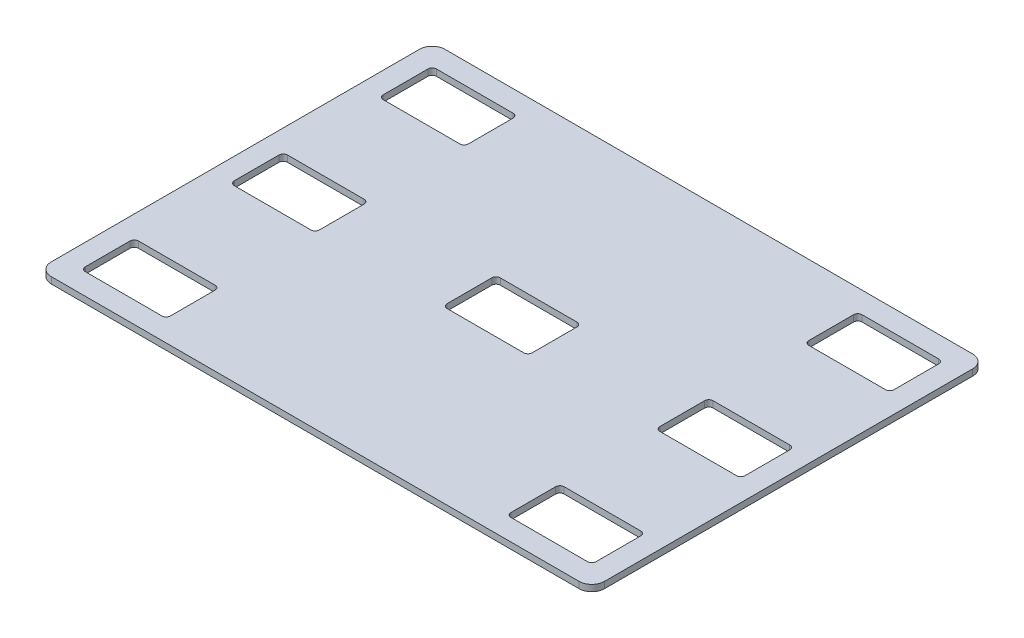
ISO-10303-21;
HEADER;
FILE_DESCRIPTION(('STEP AP214'),'2;1');
FILE_NAME('part.step','',(''),(''),'','','');
FILE_SCHEMA(('AUTOMOTIVE_DESIGN { 1 0 10303 214 1 1 1 1 }'));
ENDSEC;
DATA;
#1=APPLICATION_CONTEXT('core data for automotive mechanical design processes');
#2=APPLICATION_PROTOCOL_DEFINITION('international standard','automotive_design',2000,#1);
#3=PRODUCT_CONTEXT('',#1,'mechanical');
#4=PRODUCT('Part','Part','',(#3));
#5=PRODUCT_RELATED_PRODUCT_CATEGORY('part','',(#4));
#6=PRODUCT_DEFINITION_FORMATION('','',#4);
#7=PRODUCT_DEFINITION_CONTEXT('part definition',#1,'design');
#8=PRODUCT_DEFINITION('design','',#6,#7);
#9=PRODUCT_DEFINITION_SHAPE('','',#8);
#10=(LENGTH_UNIT() NAMED_UNIT(*) SI_UNIT(.MILLI.,.METRE.));
#11=(NAMED_UNIT(*) PLANE_ANGLE_UNIT() SI_UNIT($,.RADIAN.));
#12=(NAMED_UNIT(*) SI_UNIT($,.STERADIAN.) SOLID_ANGLE_UNIT());
#13=UNCERTAINTY_MEASURE_WITH_UNIT(LENGTH_MEASURE(1.E-05),#10,'distance_accuracy_value','');
#14=(GEOMETRIC_REPRESENTATION_CONTEXT(3) GLOBAL_UNCERTAINTY_ASSIGNED_CONTEXT((#13)) GLOBAL_UNIT_ASSIGNED_CONTEXT((#10,
#11,#12)) REPRESENTATION_CONTEXT('',''));
#15=CARTESIAN_POINT('',(0.,0.,0.));
#16=DIRECTION('',(0.,0.,1.));
#17=DIRECTION('',(1.,0.,0.));
#18=AXIS2_PLACEMENT_3D('',#15,#16,#17);
#19=CARTESIAN_POINT('',(212.,0.,-173.));
#20=DIRECTION('',(0.,-1.,0.));
#21=DIRECTION('',(0.,0.,-1.));
#22=AXIS2_PLACEMENT_3D('',#19,#20,#21);
#23=CYLINDRICAL_SURFACE('',#22,2.);
#24=CARTESIAN_POINT('',(212.,0.,-173.));
#25=DIRECTION('',(0.,-1.,0.));
#26=DIRECTION('',(0.,0.,-1.));
#27=AXIS2_PLACEMENT_3D('',#24,#25,#26);
#28=CIRCLE('',#27,2.);
#29=CARTESIAN_POINT('',(212.,0.,-175.));
#30=VERTEX_POINT('',#29);
#31=CARTESIAN_POINT('',(210.,0.,-173.));
#32=VERTEX_POINT('',#31);
#33=EDGE_CURVE('E915',#30,#32,#28,.F.);
#34=ORIENTED_EDGE('',*,*,#33,.F.);
#35=DIRECTION('',(0.,1.,0.));
#36=VECTOR('',#35,1.);
#37=CARTESIAN_POINT('',(212.,0.,-175.));
#38=LINE('',#37,#36);
#39=CARTESIAN_POINT('',(212.,3.,-175.));
#40=VERTEX_POINT('',#39);
#41=EDGE_CURVE('E12',#40,#30,#38,.F.);
#42=ORIENTED_EDGE('',*,*,#41,.F.);
#43=CARTESIAN_POINT('',(212.,3.,-173.));
#44=DIRECTION('',(0.,-1.,0.));
#45=DIRECTION('',(0.,0.,-1.));
#46=AXIS2_PLACEMENT_3D('',#43,#44,#45);
#47=CIRCLE('',#46,2.);
#48=CARTESIAN_POINT('',(210.,3.,-173.));
#49=VERTEX_POINT('',#48);
#50=EDGE_CURVE('E885',#49,#40,#47,.T.);
#51=ORIENTED_EDGE('',*,*,#50,.F.);
#52=DIRECTION('',(0.,1.,0.));
#53=VECTOR('',#52,1.);
#54=CARTESIAN_POINT('',(210.,3.,-173.));
#55=LINE('',#54,#53);
#56=EDGE_CURVE('E919',#32,#49,#55,.T.);
#57=ORIENTED_EDGE('',*,*,#56,.F.);
#58=EDGE_LOOP('',(#34,#42,#51,#57));
#59=FACE_BOUND('',#58,.T.);
#60=ADVANCED_FACE('F39',(#59),#23,.F.);
#61=CARTESIAN_POINT('',(210.,0.,-175.));
#62=DIRECTION('',(0.,0.,-1.));
#63=DIRECTION('',(-1.,0.,0.));
#64=AXIS2_PLACEMENT_3D('',#61,#62,#63);
#65=PLANE('',#64);
#66=DIRECTION('',(-1.,0.,0.));
#67=VECTOR('',#66,1.);
#68=CARTESIAN_POINT('',(210.,0.,-175.));
#69=LINE('',#68,#67);
#70=CARTESIAN_POINT('',(248.,0.,-175.));
#71=VERTEX_POINT('',#70);
#72=EDGE_CURVE('E60',#71,#30,#69,.T.);
#73=ORIENTED_EDGE('',*,*,#72,.F.);
#74=DIRECTION('',(0.,1.,0.));
#75=VECTOR('',#74,1.);
#76=CARTESIAN_POINT('',(248.,3.,-175.));
#77=LINE('',#76,#75);
#78=CARTESIAN_POINT('',(248.,3.,-175.));
#79=VERTEX_POINT('',#78);
#80=EDGE_CURVE('E46',#71,#79,#77,.T.);
#81=ORIENTED_EDGE('',*,*,#80,.T.);
#82=DIRECTION('',(-1.,0.,0.));
#83=VECTOR('',#82,1.);
#84=CARTESIAN_POINT('',(210.,3.,-175.));
#85=LINE('',#84,#83);
#86=EDGE_CURVE('E887',#79,#40,#85,.T.);
#87=ORIENTED_EDGE('',*,*,#86,.T.);
#88=ORIENTED_EDGE('',*,*,#41,.T.);
#89=EDGE_LOOP('',(#73,#81,#87,#88));
#90=FACE_BOUND('',#89,.T.);
#91=ADVANCED_FACE('F935',(#90),#65,.F.);
#92=CARTESIAN_POINT('',(248.,0.,-173.));
#93=DIRECTION('',(0.,-1.,0.));
#94=DIRECTION('',(0.,0.,-1.));
#95=AXIS2_PLACEMENT_3D('',#92,#93,#94);
#96=CYLINDRICAL_SURFACE('',#95,2.);
#97=CARTESIAN_POINT('',(248.,0.,-173.));
#98=DIRECTION('',(0.,-1.,0.));
#99=DIRECTION('',(0.,0.,-1.));
#100=AXIS2_PLACEMENT_3D('',#97,#98,#99);
#101=CIRCLE('',#100,2.);
#102=CARTESIAN_POINT('',(250.,0.,-173.));
#103=VERTEX_POINT('',#102);
#104=EDGE_CURVE('E912',#103,#71,#101,.F.);
#105=ORIENTED_EDGE('',*,*,#104,.F.);
#106=DIRECTION('',(0.,1.,0.));
#107=VECTOR('',#106,1.);
#108=CARTESIAN_POINT('',(250.,0.,-173.));
#109=LINE('',#108,#107);
#110=CARTESIAN_POINT('',(250.,3.,-173.));
#111=VERTEX_POINT('',#110);
#112=EDGE_CURVE('E930',#111,#103,#109,.F.);
#113=ORIENTED_EDGE('',*,*,#112,.F.);
#114=CARTESIAN_POINT('',(248.,3.,-173.));
#115=DIRECTION('',(0.,-1.,0.));
#116=DIRECTION('',(0.,0.,-1.));
#117=AXIS2_PLACEMENT_3D('',#114,#115,#116);
#118=CIRCLE('',#117,2.);
#119=EDGE_CURVE('E890',#79,#111,#118,.T.);
#120=ORIENTED_EDGE('',*,*,#119,.F.);
#121=ORIENTED_EDGE('',*,*,#80,.F.);
#122=EDGE_LOOP('',(#105,#113,#120,#121));
#123=FACE_BOUND('',#122,.T.);
#124=ADVANCED_FACE('F940',(#123),#96,.F.);
#125=CARTESIAN_POINT('',(250.,0.,-150.));
#126=DIRECTION('',(1.,0.,0.));
#127=DIRECTION('',(0.,0.,-1.));
#128=AXIS2_PLACEMENT_3D('',#125,#126,#127);
#129=PLANE('',#128);
#130=DIRECTION('',(0.,0.,-1.));
#131=VECTOR('',#130,1.);
#132=CARTESIAN_POINT('',(250.,3.,-150.));
#133=LINE('',#132,#131);
#134=CARTESIAN_POINT('',(250.,3.,-152.));
#135=VERTEX_POINT('',#134);
#136=EDGE_CURVE('E892',#135,#111,#133,.T.);
#137=ORIENTED_EDGE('',*,*,#136,.T.);
#138=ORIENTED_EDGE('',*,*,#112,.T.);
#139=DIRECTION('',(0.,0.,-1.));
#140=VECTOR('',#139,1.);
#141=CARTESIAN_POINT('',(250.,0.,-150.));
#142=LINE('',#141,#140);
#143=CARTESIAN_POINT('',(250.,0.,-152.));
#144=VERTEX_POINT('',#143);
#145=EDGE_CURVE('E910',#144,#103,#142,.T.);
#146=ORIENTED_EDGE('',*,*,#145,.F.);
#147=DIRECTION('',(0.,1.,0.));
#148=VECTOR('',#147,1.);
#149=CARTESIAN_POINT('',(250.,3.,-152.));
#150=LINE('',#149,#148);
#151=EDGE_CURVE('E927',#144,#135,#150,.T.);
#152=ORIENTED_EDGE('',*,*,#151,.T.);
#153=EDGE_LOOP('',(#137,#138,#146,#152));
#154=FACE_BOUND('',#153,.T.);
#155=ADVANCED_FACE('F946',(#154),#129,.F.);
#156=CARTESIAN_POINT('',(248.,0.,-152.));
#157=DIRECTION('',(0.,-1.,0.));
#158=DIRECTION('',(0.,0.,-1.));
#159=AXIS2_PLACEMENT_3D('',#156,#157,#158);
#160=CYLINDRICAL_SURFACE('',#159,2.);
#161=CARTESIAN_POINT('',(248.,0.,-152.));
#162=DIRECTION('',(0.,-1.,0.));
#163=DIRECTION('',(0.,0.,-1.));
#164=AXIS2_PLACEMENT_3D('',#161,#162,#163);
#165=CIRCLE('',#164,2.);
#166=CARTESIAN_POINT('',(248.,0.,-150.));
#167=VERTEX_POINT('',#166);
#168=EDGE_CURVE('E908',#167,#144,#165,.F.);
#169=ORIENTED_EDGE('',*,*,#168,.F.);
#170=DIRECTION('',(0.,1.,0.));
#171=VECTOR('',#170,1.);
#172=CARTESIAN_POINT('',(248.,0.,-150.));
#173=LINE('',#172,#171);
#174=CARTESIAN_POINT('',(248.,3.,-150.));
#175=VERTEX_POINT('',#174);
#176=EDGE_CURVE('E924',#175,#167,#173,.F.);
#177=ORIENTED_EDGE('',*,*,#176,.F.);
#178=CARTESIAN_POINT('',(248.,3.,-152.));
#179=DIRECTION('',(0.,-1.,0.));
#180=DIRECTION('',(0.,0.,-1.));
#181=AXIS2_PLACEMENT_3D('',#178,#179,#180);
#182=CIRCLE('',#181,2.);
#183=EDGE_CURVE('E895',#135,#175,#182,.T.);
#184=ORIENTED_EDGE('',*,*,#183,.F.);
#185=ORIENTED_EDGE('',*,*,#151,.F.);
#186=EDGE_LOOP('',(#169,#177,#184,#185));
#187=FACE_BOUND('',#186,.T.);
#188=ADVANCED_FACE('F951',(#187),#160,.F.);
#189=CARTESIAN_POINT('',(210.,0.,-150.));
#190=DIRECTION('',(0.,0.,1.));
#191=DIRECTION('',(1.,0.,0.));
#192=AXIS2_PLACEMENT_3D('',#189,#190,#191);
#193=PLANE('',#192);
#194=DIRECTION('',(1.,0.,0.));
#195=VECTOR('',#194,1.);
#196=CARTESIAN_POINT('',(210.,3.,-150.));
#197=LINE('',#196,#195);
#198=CARTESIAN_POINT('',(212.,3.,-150.));
#199=VERTEX_POINT('',#198);
#200=EDGE_CURVE('E897',#199,#175,#197,.T.);
#201=ORIENTED_EDGE('',*,*,#200,.T.);
#202=ORIENTED_EDGE('',*,*,#176,.T.);
#203=DIRECTION('',(1.,0.,0.));
#204=VECTOR('',#203,1.);
#205=CARTESIAN_POINT('',(210.,0.,-150.));
#206=LINE('',#205,#204);
#207=CARTESIAN_POINT('',(212.,0.,-150.));
#208=VERTEX_POINT('',#207);
#209=EDGE_CURVE('E906',#208,#167,#206,.T.);
#210=ORIENTED_EDGE('',*,*,#209,.F.);
#211=DIRECTION('',(0.,1.,0.));
#212=VECTOR('',#211,1.);
#213=CARTESIAN_POINT('',(212.,3.,-150.));
#214=LINE('',#213,#212);
#215=EDGE_CURVE('E921',#208,#199,#214,.T.);
#216=ORIENTED_EDGE('',*,*,#215,.T.);
#217=EDGE_LOOP('',(#201,#202,#210,#216));
#218=FACE_BOUND('',#217,.T.);
#219=ADVANCED_FACE('F955',(#218),#193,.F.);
#220=CARTESIAN_POINT('',(212.,0.,-152.));
#221=DIRECTION('',(0.,-1.,0.));
#222=DIRECTION('',(0.,0.,-1.));
#223=AXIS2_PLACEMENT_3D('',#220,#221,#222);
#224=CYLINDRICAL_SURFACE('',#223,2.);
#225=CARTESIAN_POINT('',(212.,0.,-152.));
#226=DIRECTION('',(0.,-1.,0.));
#227=DIRECTION('',(0.,0.,-1.));
#228=AXIS2_PLACEMENT_3D('',#225,#226,#227);
#229=CIRCLE('',#228,2.);
#230=CARTESIAN_POINT('',(210.,0.,-152.));
#231=VERTEX_POINT('',#230);
#232=EDGE_CURVE('E904',#231,#208,#229,.F.);
#233=ORIENTED_EDGE('',*,*,#232,.F.);
#234=DIRECTION('',(0.,1.,0.));
#235=VECTOR('',#234,1.);
#236=CARTESIAN_POINT('',(210.,0.,-152.));
#237=LINE('',#236,#235);
#238=CARTESIAN_POINT('',(210.,3.,-152.));
#239=VERTEX_POINT('',#238);
#240=EDGE_CURVE('E917',#239,#231,#237,.F.);
#241=ORIENTED_EDGE('',*,*,#240,.F.);
#242=CARTESIAN_POINT('',(212.,3.,-152.));
#243=DIRECTION('',(0.,-1.,0.));
#244=DIRECTION('',(0.,0.,-1.));
#245=AXIS2_PLACEMENT_3D('',#242,#243,#244);
#246=CIRCLE('',#245,2.);
#247=EDGE_CURVE('E900',#199,#239,#246,.T.);
#248=ORIENTED_EDGE('',*,*,#247,.F.);
#249=ORIENTED_EDGE('',*,*,#215,.F.);
#250=EDGE_LOOP('',(#233,#241,#248,#249));
#251=FACE_BOUND('',#250,.T.);
#252=ADVANCED_FACE('F960',(#251),#224,.F.);
#253=CARTESIAN_POINT('',(210.,0.,-150.));
#254=DIRECTION('',(-1.,0.,0.));
#255=DIRECTION('',(0.,0.,1.));
#256=AXIS2_PLACEMENT_3D('',#253,#254,#255);
#257=PLANE('',#256);
#258=DIRECTION('',(0.,0.,1.));
#259=VECTOR('',#258,1.);
#260=CARTESIAN_POINT('',(210.,3.,-150.));
#261=LINE('',#260,#259);
#262=EDGE_CURVE('E883',#49,#239,#261,.T.);
#263=ORIENTED_EDGE('',*,*,#262,.T.);
#264=ORIENTED_EDGE('',*,*,#240,.T.);
#265=DIRECTION('',(0.,0.,1.));
#266=VECTOR('',#265,1.);
#267=CARTESIAN_POINT('',(210.,0.,-150.));
#268=LINE('',#267,#266);
#269=EDGE_CURVE('E53',#32,#231,#268,.T.);
#270=ORIENTED_EDGE('',*,*,#269,.F.);
#271=ORIENTED_EDGE('',*,*,#56,.T.);
#272=EDGE_LOOP('',(#263,#264,#270,#271));
#273=FACE_BOUND('',#272,.T.);
#274=ADVANCED_FACE('F965',(#273),#257,.F.);
#275=CARTESIAN_POINT('',(212.,0.,-103.));
#276=DIRECTION('',(0.,-1.,0.));
#277=DIRECTION('',(0.,0.,-1.));
#278=AXIS2_PLACEMENT_3D('',#275,#276,#277);
#279=CYLINDRICAL_SURFACE('',#278,2.);
#280=CARTESIAN_POINT('',(212.,0.,-103.));
#281=DIRECTION('',(0.,-1.,0.));
#282=DIRECTION('',(0.,0.,-1.));
#283=AXIS2_PLACEMENT_3D('',#280,#281,#282);
#284=CIRCLE('',#283,2.);
#285=CARTESIAN_POINT('',(212.,0.,-105.));
#286=VERTEX_POINT('',#285);
#287=CARTESIAN_POINT('',(210.,0.,-103.));
#288=VERTEX_POINT('',#287);
#289=EDGE_CURVE('E856',#286,#288,#284,.F.);
#290=ORIENTED_EDGE('',*,*,#289,.F.);
#291=DIRECTION('',(0.,1.,0.));
#292=VECTOR('',#291,1.);
#293=CARTESIAN_POINT('',(212.,0.,-105.));
#294=LINE('',#293,#292);
#295=CARTESIAN_POINT('',(212.,3.,-105.));
#296=VERTEX_POINT('',#295);
#297=EDGE_CURVE('E880',#296,#286,#294,.F.);
#298=ORIENTED_EDGE('',*,*,#297,.F.);
#299=CARTESIAN_POINT('',(212.,3.,-103.));
#300=DIRECTION('',(0.,-1.,0.));
#301=DIRECTION('',(0.,0.,-1.));
#302=AXIS2_PLACEMENT_3D('',#299,#300,#301);
#303=CIRCLE('',#302,2.);
#304=CARTESIAN_POINT('',(210.,3.,-103.));
#305=VERTEX_POINT('',#304);
#306=EDGE_CURVE('E824',#305,#296,#303,.T.);
#307=ORIENTED_EDGE('',*,*,#306,.F.);
#308=DIRECTION('',(0.,1.,0.));
#309=VECTOR('',#308,1.);
#310=CARTESIAN_POINT('',(210.,3.,-103.));
#311=LINE('',#310,#309);
#312=EDGE_CURVE('E862',#288,#305,#311,.T.);
#313=ORIENTED_EDGE('',*,*,#312,.F.);
#314=EDGE_LOOP('',(#290,#298,#307,#313));
#315=FACE_BOUND('',#314,.T.);
#316=ADVANCED_FACE('F967',(#315),#279,.F.);
#317=CARTESIAN_POINT('',(210.,0.,-105.));
#318=DIRECTION('',(0.,0.,-1.));
#319=DIRECTION('',(-1.,0.,0.));
#320=AXIS2_PLACEMENT_3D('',#317,#318,#319);
#321=PLANE('',#320);
#322=DIRECTION('',(-1.,0.,0.));
#323=VECTOR('',#322,1.);
#324=CARTESIAN_POINT('',(210.,0.,-105.));
#325=LINE('',#324,#323);
#326=CARTESIAN_POINT('',(248.,0.,-105.));
#327=VERTEX_POINT('',#326);
#328=EDGE_CURVE('E854',#327,#286,#325,.T.);
#329=ORIENTED_EDGE('',*,*,#328,.F.);
#330=DIRECTION('',(0.,1.,0.));
#331=VECTOR('',#330,1.);
#332=CARTESIAN_POINT('',(248.,3.,-105.));
#333=LINE('',#332,#331);
#334=CARTESIAN_POINT('',(248.,3.,-105.));
#335=VERTEX_POINT('',#334);
#336=EDGE_CURVE('E877',#327,#335,#333,.T.);
#337=ORIENTED_EDGE('',*,*,#336,.T.);
#338=DIRECTION('',(-1.,0.,0.));
#339=VECTOR('',#338,1.);
#340=CARTESIAN_POINT('',(210.,3.,-105.));
#341=LINE('',#340,#339);
#342=EDGE_CURVE('E826',#335,#296,#341,.T.);
#343=ORIENTED_EDGE('',*,*,#342,.T.);
#344=ORIENTED_EDGE('',*,*,#297,.T.);
#345=EDGE_LOOP('',(#329,#337,#343,#344));
#346=FACE_BOUND('',#345,.T.);
#347=ADVANCED_FACE('F973',(#346),#321,.F.);
#348=CARTESIAN_POINT('',(248.,0.,-103.));
#349=DIRECTION('',(0.,-1.,0.));
#350=DIRECTION('',(0.,0.,-1.));
#351=AXIS2_PLACEMENT_3D('',#348,#349,#350);
#352=CYLINDRICAL_SURFACE('',#351,2.);
#353=CARTESIAN_POINT('',(248.,0.,-103.));
#354=DIRECTION('',(0.,-1.,0.));
#355=DIRECTION('',(0.,0.,-1.));
#356=AXIS2_PLACEMENT_3D('',#353,#354,#355);
#357=CIRCLE('',#356,2.);
#358=CARTESIAN_POINT('',(250.,0.,-103.));
#359=VERTEX_POINT('',#358);
#360=EDGE_CURVE('E852',#359,#327,#357,.F.);
#361=ORIENTED_EDGE('',*,*,#360,.F.);
#362=DIRECTION('',(0.,1.,0.));
#363=VECTOR('',#362,1.);
#364=CARTESIAN_POINT('',(250.,0.,-103.));
#365=LINE('',#364,#363);
#366=CARTESIAN_POINT('',(250.,3.,-103.));
#367=VERTEX_POINT('',#366);
#368=EDGE_CURVE('E874',#367,#359,#365,.F.);
#369=ORIENTED_EDGE('',*,*,#368,.F.);
#370=CARTESIAN_POINT('',(248.,3.,-103.));
#371=DIRECTION('',(0.,-1.,0.));
#372=DIRECTION('',(0.,0.,-1.));
#373=AXIS2_PLACEMENT_3D('',#370,#371,#372);
#374=CIRCLE('',#373,2.);
#375=EDGE_CURVE('E829',#335,#367,#374,.T.);
#376=ORIENTED_EDGE('',*,*,#375,.F.);
#377=ORIENTED_EDGE('',*,*,#336,.F.);
#378=EDGE_LOOP('',(#361,#369,#376,#377));
#379=FACE_BOUND('',#378,.T.);
#380=ADVANCED_FACE('F1018',(#379),#352,.F.);
#381=CARTESIAN_POINT('',(250.,0.,-80.));
#382=DIRECTION('',(1.,0.,0.));
#383=DIRECTION('',(0.,0.,-1.));
#384=AXIS2_PLACEMENT_3D('',#381,#382,#383);
#385=PLANE('',#384);
#386=DIRECTION('',(0.,0.,-1.));
#387=VECTOR('',#386,1.);
#388=CARTESIAN_POINT('',(250.,3.,-80.));
#389=LINE('',#388,#387);
#390=CARTESIAN_POINT('',(250.,3.,-82.));
#391=VERTEX_POINT('',#390);
#392=EDGE_CURVE('E831',#391,#367,#389,.T.);
#393=ORIENTED_EDGE('',*,*,#392,.T.);
#394=ORIENTED_EDGE('',*,*,#368,.T.);
#395=DIRECTION('',(0.,0.,-1.));
#396=VECTOR('',#395,1.);
#397=CARTESIAN_POINT('',(250.,0.,-80.));
#398=LINE('',#397,#396);
#399=CARTESIAN_POINT('',(250.,0.,-82.));
#400=VERTEX_POINT('',#399);
#401=EDGE_CURVE('E850',#400,#359,#398,.T.);
#402=ORIENTED_EDGE('',*,*,#401,.F.);
#403=DIRECTION('',(0.,1.,0.));
#404=VECTOR('',#403,1.);
#405=CARTESIAN_POINT('',(250.,3.,-82.));
#406=LINE('',#405,#404);
#407=EDGE_CURVE('E871',#400,#391,#406,.T.);
#408=ORIENTED_EDGE('',*,*,#407,.T.);
#409=EDGE_LOOP('',(#393,#394,#402,#408));
#410=FACE_BOUND('',#409,.T.);
#411=ADVANCED_FACE('F1028',(#410),#385,.F.);
#412=CARTESIAN_POINT('',(248.,0.,-82.));
#413=DIRECTION('',(0.,-1.,0.));
#414=DIRECTION('',(0.,0.,-1.));
#415=AXIS2_PLACEMENT_3D('',#412,#413,#414);
#416=CYLINDRICAL_SURFACE('',#415,2.);
#417=CARTESIAN_POINT('',(248.,0.,-82.));
#418=DIRECTION('',(0.,-1.,0.));
#419=DIRECTION('',(0.,0.,-1.));
#420=AXIS2_PLACEMENT_3D('',#417,#418,#419);
#421=CIRCLE('',#420,2.);
#422=CARTESIAN_POINT('',(248.,0.,-80.));
#423=VERTEX_POINT('',#422);
#424=EDGE_CURVE('E848',#423,#400,#421,.F.);
#425=ORIENTED_EDGE('',*,*,#424,.F.);
#426=DIRECTION('',(0.,1.,0.));
#427=VECTOR('',#426,1.);
#428=CARTESIAN_POINT('',(248.,0.,-80.));
#429=LINE('',#428,#427);
#430=CARTESIAN_POINT('',(248.,3.,-80.));
#431=VERTEX_POINT('',#430);
#432=EDGE_CURVE('E868',#431,#423,#429,.F.);
#433=ORIENTED_EDGE('',*,*,#432,.F.);
#434=CARTESIAN_POINT('',(248.,3.,-82.));
#435=DIRECTION('',(0.,-1.,0.));
#436=DIRECTION('',(0.,0.,-1.));
#437=AXIS2_PLACEMENT_3D('',#434,#435,#436);
#438=CIRCLE('',#437,2.);
#439=EDGE_CURVE('E834',#391,#431,#438,.T.);
#440=ORIENTED_EDGE('',*,*,#439,.F.);
#441=ORIENTED_EDGE('',*,*,#407,.F.);
#442=EDGE_LOOP('',(#425,#433,#440,#441));
#443=FACE_BOUND('',#442,.T.);
#444=ADVANCED_FACE('F1038',(#443),#416,.F.);
#445=CARTESIAN_POINT('',(210.,0.,-80.));
#446=DIRECTION('',(0.,0.,1.));
#447=DIRECTION('',(1.,0.,0.));
#448=AXIS2_PLACEMENT_3D('',#445,#446,#447);
#449=PLANE('',#448);
#450=DIRECTION('',(1.,0.,0.));
#451=VECTOR('',#450,1.);
#452=CARTESIAN_POINT('',(210.,3.,-80.));
#453=LINE('',#452,#451);
#454=CARTESIAN_POINT('',(212.,3.,-80.));
#455=VERTEX_POINT('',#454);
#456=EDGE_CURVE('E836',#455,#431,#453,.T.);
#457=ORIENTED_EDGE('',*,*,#456,.T.);
#458=ORIENTED_EDGE('',*,*,#432,.T.);
#459=DIRECTION('',(1.,0.,0.));
#460=VECTOR('',#459,1.);
#461=CARTESIAN_POINT('',(210.,0.,-80.));
#462=LINE('',#461,#460);
#463=CARTESIAN_POINT('',(212.,0.,-80.));
#464=VERTEX_POINT('',#463);
#465=EDGE_CURVE('E846',#464,#423,#462,.T.);
#466=ORIENTED_EDGE('',*,*,#465,.F.);
#467=DIRECTION('',(0.,1.,0.));
#468=VECTOR('',#467,1.);
#469=CARTESIAN_POINT('',(212.,3.,-80.));
#470=LINE('',#469,#468);
#471=EDGE_CURVE('E865',#464,#455,#470,.T.);
#472=ORIENTED_EDGE('',*,*,#471,.T.);
#473=EDGE_LOOP('',(#457,#458,#466,#472));
#474=FACE_BOUND('',#473,.T.);
#475=ADVANCED_FACE('F1048',(#474),#449,.F.);
#476=CARTESIAN_POINT('',(212.,0.,-82.));
#477=DIRECTION('',(0.,-1.,0.));
#478=DIRECTION('',(0.,0.,-1.));
#479=AXIS2_PLACEMENT_3D('',#476,#477,#478);
#480=CYLINDRICAL_SURFACE('',#479,2.);
#481=CARTESIAN_POINT('',(212.,0.,-82.));
#482=DIRECTION('',(0.,-1.,0.));
#483=DIRECTION('',(0.,0.,-1.));
#484=AXIS2_PLACEMENT_3D('',#481,#482,#483);
#485=CIRCLE('',#484,2.);
#486=CARTESIAN_POINT('',(210.,0.,-82.));
#487=VERTEX_POINT('',#486);
#488=EDGE_CURVE('E844',#487,#464,#485,.F.);
#489=ORIENTED_EDGE('',*,*,#488,.F.);
#490=DIRECTION('',(0.,1.,0.));
#491=VECTOR('',#490,1.);
#492=CARTESIAN_POINT('',(210.,0.,-82.));
#493=LINE('',#492,#491);
#494=CARTESIAN_POINT('',(210.,3.,-82.));
#495=VERTEX_POINT('',#494);
#496=EDGE_CURVE('E859',#495,#487,#493,.F.);
#497=ORIENTED_EDGE('',*,*,#496,.F.);
#498=CARTESIAN_POINT('',(212.,3.,-82.));
#499=DIRECTION('',(0.,-1.,0.));
#500=DIRECTION('',(0.,0.,-1.));
#501=AXIS2_PLACEMENT_3D('',#498,#499,#500);
#502=CIRCLE('',#501,2.);
#503=EDGE_CURVE('E839',#455,#495,#502,.T.);
#504=ORIENTED_EDGE('',*,*,#503,.F.);
#505=ORIENTED_EDGE('',*,*,#471,.F.);
#506=EDGE_LOOP('',(#489,#497,#504,#505));
#507=FACE_BOUND('',#506,.T.);
#508=ADVANCED_FACE('F1058',(#507),#480,.F.);
#509=CARTESIAN_POINT('',(210.,0.,-80.));
#510=DIRECTION('',(-1.,0.,0.));
#511=DIRECTION('',(0.,0.,1.));
#512=AXIS2_PLACEMENT_3D('',#509,#510,#511);
#513=PLANE('',#512);
#514=DIRECTION('',(0.,0.,1.));
#515=VECTOR('',#514,1.);
#516=CARTESIAN_POINT('',(210.,3.,-80.));
#517=LINE('',#516,#515);
#518=EDGE_CURVE('E822',#305,#495,#517,.T.);
#519=ORIENTED_EDGE('',*,*,#518,.T.);
#520=ORIENTED_EDGE('',*,*,#496,.T.);
#521=DIRECTION('',(0.,0.,1.));
#522=VECTOR('',#521,1.);
#523=CARTESIAN_POINT('',(210.,0.,-80.));
#524=LINE('',#523,#522);
#525=EDGE_CURVE('E842',#288,#487,#524,.T.);
#526=ORIENTED_EDGE('',*,*,#525,.F.);
#527=ORIENTED_EDGE('',*,*,#312,.T.);
#528=EDGE_LOOP('',(#519,#520,#526,#527));
#529=FACE_BOUND('',#528,.T.);
#530=ADVANCED_FACE('F1068',(#529),#513,.F.);
#531=CARTESIAN_POINT('',(212.,0.,-33.));
#532=DIRECTION('',(0.,-1.,0.));
#533=DIRECTION('',(0.,0.,-1.));
#534=AXIS2_PLACEMENT_3D('',#531,#532,#533);
#535=CYLINDRICAL_SURFACE('',#534,2.);
#536=CARTESIAN_POINT('',(212.,0.,-33.));
#537=DIRECTION('',(0.,-1.,0.));
#538=DIRECTION('',(0.,0.,-1.));
#539=AXIS2_PLACEMENT_3D('',#536,#537,#538);
#540=CIRCLE('',#539,2.);
#541=CARTESIAN_POINT('',(212.,0.,-35.));
#542=VERTEX_POINT('',#541);
#543=CARTESIAN_POINT('',(210.,0.,-33.));
#544=VERTEX_POINT('',#543);
#545=EDGE_CURVE('E795',#542,#544,#540,.F.);
#546=ORIENTED_EDGE('',*,*,#545,.F.);
#547=DIRECTION('',(0.,1.,0.));
#548=VECTOR('',#547,1.);
#549=CARTESIAN_POINT('',(212.,0.,-35.));
#550=LINE('',#549,#548);
#551=CARTESIAN_POINT('',(212.,3.,-35.));
#552=VERTEX_POINT('',#551);
#553=EDGE_CURVE('E819',#552,#542,#550,.F.);
#554=ORIENTED_EDGE('',*,*,#553,.F.);
#555=CARTESIAN_POINT('',(212.,3.,-33.));
#556=DIRECTION('',(0.,-1.,0.));
#557=DIRECTION('',(0.,0.,-1.));
#558=AXIS2_PLACEMENT_3D('',#555,#556,#557);
#559=CIRCLE('',#558,2.);
#560=CARTESIAN_POINT('',(210.,3.,-33.));
#561=VERTEX_POINT('',#560);
#562=EDGE_CURVE('E763',#561,#552,#559,.T.);
#563=ORIENTED_EDGE('',*,*,#562,.F.);
#564=DIRECTION('',(0.,1.,0.));
#565=VECTOR('',#564,1.);
#566=CARTESIAN_POINT('',(210.,3.,-33.));
#567=LINE('',#566,#565);
#568=EDGE_CURVE('E801',#544,#561,#567,.T.);
#569=ORIENTED_EDGE('',*,*,#568,.F.);
#570=EDGE_LOOP('',(#546,#554,#563,#569));
#571=FACE_BOUND('',#570,.T.);
#572=ADVANCED_FACE('F1078',(#571),#535,.F.);
#573=CARTESIAN_POINT('',(210.,0.,-35.));
#574=DIRECTION('',(0.,0.,-1.));
#575=DIRECTION('',(-1.,0.,0.));
#576=AXIS2_PLACEMENT_3D('',#573,#574,#575);
#577=PLANE('',#576);
#578=DIRECTION('',(-1.,0.,0.));
#579=VECTOR('',#578,1.);
#580=CARTESIAN_POINT('',(210.,0.,-35.));
#581=LINE('',#580,#579);
#582=CARTESIAN_POINT('',(248.,0.,-35.));
#583=VERTEX_POINT('',#582);
#584=EDGE_CURVE('E793',#583,#542,#581,.T.);
#585=ORIENTED_EDGE('',*,*,#584,.F.);
#586=DIRECTION('',(0.,1.,0.));
#587=VECTOR('',#586,1.);
#588=CARTESIAN_POINT('',(248.,3.,-35.));
#589=LINE('',#588,#587);
#590=CARTESIAN_POINT('',(248.,3.,-35.));
#591=VERTEX_POINT('',#590);
#592=EDGE_CURVE('E816',#583,#591,#589,.T.);
#593=ORIENTED_EDGE('',*,*,#592,.T.);
#594=DIRECTION('',(-1.,0.,0.));
#595=VECTOR('',#594,1.);
#596=CARTESIAN_POINT('',(210.,3.,-35.));
#597=LINE('',#596,#595);
#598=EDGE_CURVE('E765',#591,#552,#597,.T.);
#599=ORIENTED_EDGE('',*,*,#598,.T.);
#600=ORIENTED_EDGE('',*,*,#553,.T.);
#601=EDGE_LOOP('',(#585,#593,#599,#600));
#602=FACE_BOUND('',#601,.T.);
#603=ADVANCED_FACE('F1088',(#602),#577,.F.);
#604=CARTESIAN_POINT('',(248.,0.,-33.));
#605=DIRECTION('',(0.,-1.,0.));
#606=DIRECTION('',(0.,0.,-1.));
#607=AXIS2_PLACEMENT_3D('',#604,#605,#606);
#608=CYLINDRICAL_SURFACE('',#607,2.);
#609=CARTESIAN_POINT('',(248.,0.,-33.));
#610=DIRECTION('',(0.,-1.,0.));
#611=DIRECTION('',(0.,0.,-1.));
#612=AXIS2_PLACEMENT_3D('',#609,#610,#611);
#613=CIRCLE('',#612,2.);
#614=CARTESIAN_POINT('',(250.,0.,-33.));
#615=VERTEX_POINT('',#614);
#616=EDGE_CURVE('E791',#615,#583,#613,.F.);
#617=ORIENTED_EDGE('',*,*,#616,.F.);
#618=DIRECTION('',(0.,1.,0.));
#619=VECTOR('',#618,1.);
#620=CARTESIAN_POINT('',(250.,0.,-33.));
#621=LINE('',#620,#619);
#622=CARTESIAN_POINT('',(250.,3.,-33.));
#623=VERTEX_POINT('',#622);
#624=EDGE_CURVE('E813',#623,#615,#621,.F.);
#625=ORIENTED_EDGE('',*,*,#624,.F.);
#626=CARTESIAN_POINT('',(248.,3.,-33.));
#627=DIRECTION('',(0.,-1.,0.));
#628=DIRECTION('',(0.,0.,-1.));
#629=AXIS2_PLACEMENT_3D('',#626,#627,#628);
#630=CIRCLE('',#629,2.);
#631=EDGE_CURVE('E768',#591,#623,#630,.T.);
#632=ORIENTED_EDGE('',*,*,#631,.F.);
#633=ORIENTED_EDGE('',*,*,#592,.F.);
#634=EDGE_LOOP('',(#617,#625,#632,#633));
#635=FACE_BOUND('',#634,.T.);
#636=ADVANCED_FACE('F1098',(#635),#608,.F.);
#637=CARTESIAN_POINT('',(250.,0.,-10.));
#638=DIRECTION('',(1.,0.,0.));
#639=DIRECTION('',(0.,0.,-1.));
#640=AXIS2_PLACEMENT_3D('',#637,#638,#639);
#641=PLANE('',#640);
#642=DIRECTION('',(0.,0.,-1.));
#643=VECTOR('',#642,1.);
#644=CARTESIAN_POINT('',(250.,3.,-10.));
#645=LINE('',#644,#643);
#646=CARTESIAN_POINT('',(250.,3.,-12.));
#647=VERTEX_POINT('',#646);
#648=EDGE_CURVE('E770',#647,#623,#645,.T.);
#649=ORIENTED_EDGE('',*,*,#648,.T.);
#650=ORIENTED_EDGE('',*,*,#624,.T.);
#651=DIRECTION('',(0.,0.,-1.));
#652=VECTOR('',#651,1.);
#653=CARTESIAN_POINT('',(250.,0.,-10.));
#654=LINE('',#653,#652);
#655=CARTESIAN_POINT('',(250.,0.,-12.));
#656=VERTEX_POINT('',#655);
#657=EDGE_CURVE('E789',#656,#615,#654,.T.);
#658=ORIENTED_EDGE('',*,*,#657,.F.);
#659=DIRECTION('',(0.,1.,0.));
#660=VECTOR('',#659,1.);
#661=CARTESIAN_POINT('',(250.,3.,-12.));
#662=LINE('',#661,#660);
#663=EDGE_CURVE('E810',#656,#647,#662,.T.);
#664=ORIENTED_EDGE('',*,*,#663,.T.);
#665=EDGE_LOOP('',(#649,#650,#658,#664));
#666=FACE_BOUND('',#665,.T.);
#667=ADVANCED_FACE('F1108',(#666),#641,.F.);
#668=CARTESIAN_POINT('',(248.,0.,-12.));
#669=DIRECTION('',(0.,-1.,0.));
#670=DIRECTION('',(0.,0.,-1.));
#671=AXIS2_PLACEMENT_3D('',#668,#669,#670);
#672=CYLINDRICAL_SURFACE('',#671,2.);
#673=CARTESIAN_POINT('',(248.,0.,-12.));
#674=DIRECTION('',(0.,-1.,0.));
#675=DIRECTION('',(0.,0.,-1.));
#676=AXIS2_PLACEMENT_3D('',#673,#674,#675);
#677=CIRCLE('',#676,2.);
#678=CARTESIAN_POINT('',(248.,0.,-10.));
#679=VERTEX_POINT('',#678);
#680=EDGE_CURVE('E787',#679,#656,#677,.F.);
#681=ORIENTED_EDGE('',*,*,#680,.F.);
#682=DIRECTION('',(0.,1.,0.));
#683=VECTOR('',#682,1.);
#684=CARTESIAN_POINT('',(248.,0.,-10.));
#685=LINE('',#684,#683);
#686=CARTESIAN_POINT('',(248.,3.,-10.));
#687=VERTEX_POINT('',#686);
#688=EDGE_CURVE('E807',#687,#679,#685,.F.);
#689=ORIENTED_EDGE('',*,*,#688,.F.);
#690=CARTESIAN_POINT('',(248.,3.,-12.));
#691=DIRECTION('',(0.,-1.,0.));
#692=DIRECTION('',(0.,0.,-1.));
#693=AXIS2_PLACEMENT_3D('',#690,#691,#692);
#694=CIRCLE('',#693,2.);
#695=EDGE_CURVE('E773',#647,#687,#694,.T.);
#696=ORIENTED_EDGE('',*,*,#695,.F.);
#697=ORIENTED_EDGE('',*,*,#663,.F.);
#698=EDGE_LOOP('',(#681,#689,#696,#697));
#699=FACE_BOUND('',#698,.T.);
#700=ADVANCED_FACE('F1118',(#699),#672,.F.);
#701=CARTESIAN_POINT('',(210.,0.,-9.99999999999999));
#702=DIRECTION('',(0.,0.,1.));
#703=DIRECTION('',(1.,0.,0.));
#704=AXIS2_PLACEMENT_3D('',#701,#702,#703);
#705=PLANE('',#704);
#706=DIRECTION('',(1.,0.,0.));
#707=VECTOR('',#706,1.);
#708=CARTESIAN_POINT('',(210.,3.,-9.99999999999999));
#709=LINE('',#708,#707);
#710=CARTESIAN_POINT('',(212.,3.,-9.99999999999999));
#711=VERTEX_POINT('',#710);
#712=EDGE_CURVE('E775',#711,#687,#709,.T.);
#713=ORIENTED_EDGE('',*,*,#712,.T.);
#714=ORIENTED_EDGE('',*,*,#688,.T.);
#715=DIRECTION('',(1.,0.,0.));
#716=VECTOR('',#715,1.);
#717=CARTESIAN_POINT('',(210.,0.,-9.99999999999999));
#718=LINE('',#717,#716);
#719=CARTESIAN_POINT('',(212.,0.,-9.99999999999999));
#720=VERTEX_POINT('',#719);
#721=EDGE_CURVE('E785',#720,#679,#718,.T.);
#722=ORIENTED_EDGE('',*,*,#721,.F.);
#723=DIRECTION('',(0.,1.,0.));
#724=VECTOR('',#723,1.);
#725=CARTESIAN_POINT('',(212.,3.,-9.99999999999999));
#726=LINE('',#725,#724);
#727=EDGE_CURVE('E804',#720,#711,#726,.T.);
#728=ORIENTED_EDGE('',*,*,#727,.T.);
#729=EDGE_LOOP('',(#713,#714,#722,#728));
#730=FACE_BOUND('',#729,.T.);
#731=ADVANCED_FACE('F1128',(#730),#705,.F.);
#732=CARTESIAN_POINT('',(212.,0.,-12.));
#733=DIRECTION('',(0.,-1.,0.));
#734=DIRECTION('',(0.,0.,-1.));
#735=AXIS2_PLACEMENT_3D('',#732,#733,#734);
#736=CYLINDRICAL_SURFACE('',#735,2.);
#737=CARTESIAN_POINT('',(212.,0.,-12.));
#738=DIRECTION('',(0.,-1.,0.));
#739=DIRECTION('',(0.,0.,-1.));
#740=AXIS2_PLACEMENT_3D('',#737,#738,#739);
#741=CIRCLE('',#740,2.);
#742=CARTESIAN_POINT('',(210.,0.,-12.));
#743=VERTEX_POINT('',#742);
#744=EDGE_CURVE('E783',#743,#720,#741,.F.);
#745=ORIENTED_EDGE('',*,*,#744,.F.);
#746=DIRECTION('',(0.,1.,0.));
#747=VECTOR('',#746,1.);
#748=CARTESIAN_POINT('',(210.,0.,-12.));
#749=LINE('',#748,#747);
#750=CARTESIAN_POINT('',(210.,3.,-12.));
#751=VERTEX_POINT('',#750);
#752=EDGE_CURVE('E798',#751,#743,#749,.F.);
#753=ORIENTED_EDGE('',*,*,#752,.F.);
#754=CARTESIAN_POINT('',(212.,3.,-12.));
#755=DIRECTION('',(0.,-1.,0.));
#756=DIRECTION('',(0.,0.,-1.));
#757=AXIS2_PLACEMENT_3D('',#754,#755,#756);
#758=CIRCLE('',#757,2.);
#759=EDGE_CURVE('E778',#711,#751,#758,.T.);
#760=ORIENTED_EDGE('',*,*,#759,.F.);
#761=ORIENTED_EDGE('',*,*,#727,.F.);
#762=EDGE_LOOP('',(#745,#753,#760,#761));
#763=FACE_BOUND('',#762,.T.);
#764=ADVANCED_FACE('F1138',(#763),#736,.F.);
#765=CARTESIAN_POINT('',(210.,0.,-9.99999999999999));
#766=DIRECTION('',(-1.,0.,0.));
#767=DIRECTION('',(0.,0.,1.));
#768=AXIS2_PLACEMENT_3D('',#765,#766,#767);
#769=PLANE('',#768);
#770=DIRECTION('',(0.,0.,1.));
#771=VECTOR('',#770,1.);
#772=CARTESIAN_POINT('',(210.,3.,-9.99999999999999));
#773=LINE('',#772,#771);
#774=EDGE_CURVE('E761',#561,#751,#773,.T.);
#775=ORIENTED_EDGE('',*,*,#774,.T.);
#776=ORIENTED_EDGE('',*,*,#752,.T.);
#777=DIRECTION('',(0.,0.,1.));
#778=VECTOR('',#777,1.);
#779=CARTESIAN_POINT('',(210.,0.,-9.99999999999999));
#780=LINE('',#779,#778);
#781=EDGE_CURVE('E781',#544,#743,#780,.T.);
#782=ORIENTED_EDGE('',*,*,#781,.F.);
#783=ORIENTED_EDGE('',*,*,#568,.T.);
#784=EDGE_LOOP('',(#775,#776,#782,#783));
#785=FACE_BOUND('',#784,.T.);
#786=ADVANCED_FACE('F1148',(#785),#769,.F.);
#787=CARTESIAN_POINT('',(112.,0.,-103.));
#788=DIRECTION('',(0.,-1.,0.));
#789=DIRECTION('',(0.,0.,-1.));
#790=AXIS2_PLACEMENT_3D('',#787,#788,#789);
#791=CYLINDRICAL_SURFACE('',#790,2.);
#792=CARTESIAN_POINT('',(112.,0.,-103.));
#793=DIRECTION('',(0.,-1.,0.));
#794=DIRECTION('',(0.,0.,-1.));
#795=AXIS2_PLACEMENT_3D('',#792,#793,#794);
#796=CIRCLE('',#795,2.);
#797=CARTESIAN_POINT('',(112.,0.,-105.));
#798=VERTEX_POINT('',#797);
#799=CARTESIAN_POINT('',(110.,0.,-103.));
#800=VERTEX_POINT('',#799);
#801=EDGE_CURVE('E734',#798,#800,#796,.F.);
#802=ORIENTED_EDGE('',*,*,#801,.F.);
#803=DIRECTION('',(0.,1.,0.));
#804=VECTOR('',#803,1.);
#805=CARTESIAN_POINT('',(112.,0.,-105.));
#806=LINE('',#805,#804);
#807=CARTESIAN_POINT('',(112.,3.,-105.));
#808=VERTEX_POINT('',#807);
#809=EDGE_CURVE('E758',#808,#798,#806,.F.);
#810=ORIENTED_EDGE('',*,*,#809,.F.);
#811=CARTESIAN_POINT('',(112.,3.,-103.));
#812=DIRECTION('',(0.,-1.,0.));
#813=DIRECTION('',(0.,0.,-1.));
#814=AXIS2_PLACEMENT_3D('',#811,#812,#813);
#815=CIRCLE('',#814,2.);
#816=CARTESIAN_POINT('',(110.,3.,-103.));
#817=VERTEX_POINT('',#816);
#818=EDGE_CURVE('E702',#817,#808,#815,.T.);
#819=ORIENTED_EDGE('',*,*,#818,.F.);
#820=DIRECTION('',(0.,1.,0.));
#821=VECTOR('',#820,1.);
#822=CARTESIAN_POINT('',(110.,3.,-103.));
#823=LINE('',#822,#821);
#824=EDGE_CURVE('E740',#800,#817,#823,.T.);
#825=ORIENTED_EDGE('',*,*,#824,.F.);
#826=EDGE_LOOP('',(#802,#810,#819,#825));
#827=FACE_BOUND('',#826,.T.);
#828=ADVANCED_FACE('F1158',(#827),#791,.F.);
#829=CARTESIAN_POINT('',(110.,0.,-105.));
#830=DIRECTION('',(0.,0.,-1.));
#831=DIRECTION('',(-1.,0.,0.));
#832=AXIS2_PLACEMENT_3D('',#829,#830,#831);
#833=PLANE('',#832);
#834=DIRECTION('',(-1.,0.,0.));
#835=VECTOR('',#834,1.);
#836=CARTESIAN_POINT('',(110.,0.,-105.));
#837=LINE('',#836,#835);
#838=CARTESIAN_POINT('',(148.,0.,-105.));
#839=VERTEX_POINT('',#838);
#840=EDGE_CURVE('E732',#839,#798,#837,.T.);
#841=ORIENTED_EDGE('',*,*,#840,.F.);
#842=DIRECTION('',(0.,1.,0.));
#843=VECTOR('',#842,1.);
#844=CARTESIAN_POINT('',(148.,3.,-105.));
#845=LINE('',#844,#843);
#846=CARTESIAN_POINT('',(148.,3.,-105.));
#847=VERTEX_POINT('',#846);
#848=EDGE_CURVE('E755',#839,#847,#845,.T.);
#849=ORIENTED_EDGE('',*,*,#848,.T.);
#850=DIRECTION('',(-1.,0.,0.));
#851=VECTOR('',#850,1.);
#852=CARTESIAN_POINT('',(110.,3.,-105.));
#853=LINE('',#852,#851);
#854=EDGE_CURVE('E704',#847,#808,#853,.T.);
#855=ORIENTED_EDGE('',*,*,#854,.T.);
#856=ORIENTED_EDGE('',*,*,#809,.T.);
#857=EDGE_LOOP('',(#841,#849,#855,#856));
#858=FACE_BOUND('',#857,.T.);
#859=ADVANCED_FACE('F1168',(#858),#833,.F.);
#860=CARTESIAN_POINT('',(148.,0.,-103.));
#861=DIRECTION('',(0.,-1.,0.));
#862=DIRECTION('',(0.,0.,-1.));
#863=AXIS2_PLACEMENT_3D('',#860,#861,#862);
#864=CYLINDRICAL_SURFACE('',#863,2.);
#865=CARTESIAN_POINT('',(148.,0.,-103.));
#866=DIRECTION('',(0.,-1.,0.));
#867=DIRECTION('',(0.,0.,-1.));
#868=AXIS2_PLACEMENT_3D('',#865,#866,#867);
#869=CIRCLE('',#868,2.);
#870=CARTESIAN_POINT('',(150.,0.,-103.));
#871=VERTEX_POINT('',#870);
#872=EDGE_CURVE('E730',#871,#839,#869,.F.);
#873=ORIENTED_EDGE('',*,*,#872,.F.);
#874=DIRECTION('',(0.,1.,0.));
#875=VECTOR('',#874,1.);
#876=CARTESIAN_POINT('',(150.,0.,-103.));
#877=LINE('',#876,#875);
#878=CARTESIAN_POINT('',(150.,3.,-103.));
#879=VERTEX_POINT('',#878);
#880=EDGE_CURVE('E752',#879,#871,#877,.F.);
#881=ORIENTED_EDGE('',*,*,#880,.F.);
#882=CARTESIAN_POINT('',(148.,3.,-103.));
#883=DIRECTION('',(0.,-1.,0.));
#884=DIRECTION('',(0.,0.,-1.));
#885=AXIS2_PLACEMENT_3D('',#882,#883,#884);
#886=CIRCLE('',#885,2.);
#887=EDGE_CURVE('E707',#847,#879,#886,.T.);
#888=ORIENTED_EDGE('',*,*,#887,.F.);
#889=ORIENTED_EDGE('',*,*,#848,.F.);
#890=EDGE_LOOP('',(#873,#881,#888,#889));
#891=FACE_BOUND('',#890,.T.);
#892=ADVANCED_FACE('F1178',(#891),#864,.F.);
#893=CARTESIAN_POINT('',(150.,0.,-80.));
#894=DIRECTION('',(1.,0.,0.));
#895=DIRECTION('',(0.,0.,-1.));
#896=AXIS2_PLACEMENT_3D('',#893,#894,#895);
#897=PLANE('',#896);
#898=DIRECTION('',(0.,0.,-1.));
#899=VECTOR('',#898,1.);
#900=CARTESIAN_POINT('',(150.,3.,-80.));
#901=LINE('',#900,#899);
#902=CARTESIAN_POINT('',(150.,3.,-82.));
#903=VERTEX_POINT('',#902);
#904=EDGE_CURVE('E709',#903,#879,#901,.T.);
#905=ORIENTED_EDGE('',*,*,#904,.T.);
#906=ORIENTED_EDGE('',*,*,#880,.T.);
#907=DIRECTION('',(0.,0.,-1.));
#908=VECTOR('',#907,1.);
#909=CARTESIAN_POINT('',(150.,0.,-80.));
#910=LINE('',#909,#908);
#911=CARTESIAN_POINT('',(150.,0.,-82.));
#912=VERTEX_POINT('',#911);
#913=EDGE_CURVE('E728',#912,#871,#910,.T.);
#914=ORIENTED_EDGE('',*,*,#913,.F.);
#915=DIRECTION('',(0.,1.,0.));
#916=VECTOR('',#915,1.);
#917=CARTESIAN_POINT('',(150.,3.,-82.));
#918=LINE('',#917,#916);
#919=EDGE_CURVE('E749',#912,#903,#918,.T.);
#920=ORIENTED_EDGE('',*,*,#919,.T.);
#921=EDGE_LOOP('',(#905,#906,#914,#920));
#922=FACE_BOUND('',#921,.T.);
#923=ADVANCED_FACE('F1188',(#922),#897,.F.);
#924=CARTESIAN_POINT('',(148.,0.,-82.));
#925=DIRECTION('',(0.,-1.,0.));
#926=DIRECTION('',(0.,0.,-1.));
#927=AXIS2_PLACEMENT_3D('',#924,#925,#926);
#928=CYLINDRICAL_SURFACE('',#927,2.);
#929=CARTESIAN_POINT('',(148.,0.,-82.));
#930=DIRECTION('',(0.,-1.,0.));
#931=DIRECTION('',(0.,0.,-1.));
#932=AXIS2_PLACEMENT_3D('',#929,#930,#931);
#933=CIRCLE('',#932,2.);
#934=CARTESIAN_POINT('',(148.,0.,-80.));
#935=VERTEX_POINT('',#934);
#936=EDGE_CURVE('E726',#935,#912,#933,.F.);
#937=ORIENTED_EDGE('',*,*,#936,.F.);
#938=DIRECTION('',(0.,1.,0.));
#939=VECTOR('',#938,1.);
#940=CARTESIAN_POINT('',(148.,0.,-80.));
#941=LINE('',#940,#939);
#942=CARTESIAN_POINT('',(148.,3.,-80.));
#943=VERTEX_POINT('',#942);
#944=EDGE_CURVE('E746',#943,#935,#941,.F.);
#945=ORIENTED_EDGE('',*,*,#944,.F.);
#946=CARTESIAN_POINT('',(148.,3.,-82.));
#947=DIRECTION('',(0.,-1.,0.));
#948=DIRECTION('',(0.,0.,-1.));
#949=AXIS2_PLACEMENT_3D('',#946,#947,#948);
#950=CIRCLE('',#949,2.);
#951=EDGE_CURVE('E712',#903,#943,#950,.T.);
#952=ORIENTED_EDGE('',*,*,#951,.F.);
#953=ORIENTED_EDGE('',*,*,#919,.F.);
#954=EDGE_LOOP('',(#937,#945,#952,#953));
#955=FACE_BOUND('',#954,.T.);
#956=ADVANCED_FACE('F1198',(#955),#928,.F.);
#957=CARTESIAN_POINT('',(110.,0.,-80.));
#958=DIRECTION('',(0.,0.,1.));
#959=DIRECTION('',(1.,0.,0.));
#960=AXIS2_PLACEMENT_3D('',#957,#958,#959);
#961=PLANE('',#960);
#962=DIRECTION('',(1.,0.,0.));
#963=VECTOR('',#962,1.);
#964=CARTESIAN_POINT('',(110.,3.,-80.));
#965=LINE('',#964,#963);
#966=CARTESIAN_POINT('',(112.,3.,-80.));
#967=VERTEX_POINT('',#966);
#968=EDGE_CURVE('E714',#967,#943,#965,.T.);
#969=ORIENTED_EDGE('',*,*,#968,.T.);
#970=ORIENTED_EDGE('',*,*,#944,.T.);
#971=DIRECTION('',(1.,0.,0.));
#972=VECTOR('',#971,1.);
#973=CARTESIAN_POINT('',(110.,0.,-80.));
#974=LINE('',#973,#972);
#975=CARTESIAN_POINT('',(112.,0.,-80.));
#976=VERTEX_POINT('',#975);
#977=EDGE_CURVE('E724',#976,#935,#974,.T.);
#978=ORIENTED_EDGE('',*,*,#977,.F.);
#979=DIRECTION('',(0.,1.,0.));
#980=VECTOR('',#979,1.);
#981=CARTESIAN_POINT('',(112.,3.,-80.));
#982=LINE('',#981,#980);
#983=EDGE_CURVE('E743',#976,#967,#982,.T.);
#984=ORIENTED_EDGE('',*,*,#983,.T.);
#985=EDGE_LOOP('',(#969,#970,#978,#984));
#986=FACE_BOUND('',#985,.T.);
#987=ADVANCED_FACE('F1208',(#986),#961,.F.);
#988=CARTESIAN_POINT('',(112.,0.,-82.));
#989=DIRECTION('',(0.,-1.,0.));
#990=DIRECTION('',(0.,0.,-1.));
#991=AXIS2_PLACEMENT_3D('',#988,#989,#990);
#992=CYLINDRICAL_SURFACE('',#991,2.);
#993=CARTESIAN_POINT('',(112.,0.,-82.));
#994=DIRECTION('',(0.,-1.,0.));
#995=DIRECTION('',(0.,0.,-1.));
#996=AXIS2_PLACEMENT_3D('',#993,#994,#995);
#997=CIRCLE('',#996,2.);
#998=CARTESIAN_POINT('',(110.,0.,-82.));
#999=VERTEX_POINT('',#998);
#1000=EDGE_CURVE('E722',#999,#976,#997,.F.);
#1001=ORIENTED_EDGE('',*,*,#1000,.F.);
#1002=DIRECTION('',(0.,1.,0.));
#1003=VECTOR('',#1002,1.);
#1004=CARTESIAN_POINT('',(110.,0.,-82.));
#1005=LINE('',#1004,#1003);
#1006=CARTESIAN_POINT('',(110.,3.,-82.));
#1007=VERTEX_POINT('',#1006);
#1008=EDGE_CURVE('E737',#1007,#999,#1005,.F.);
#1009=ORIENTED_EDGE('',*,*,#1008,.F.);
#1010=CARTESIAN_POINT('',(112.,3.,-82.));
#1011=DIRECTION('',(0.,-1.,0.));
#1012=DIRECTION('',(0.,0.,-1.));
#1013=AXIS2_PLACEMENT_3D('',#1010,#1011,#1012);
#1014=CIRCLE('',#1013,2.);
#1015=EDGE_CURVE('E717',#967,#1007,#1014,.T.);
#1016=ORIENTED_EDGE('',*,*,#1015,.F.);
#1017=ORIENTED_EDGE('',*,*,#983,.F.);
#1018=EDGE_LOOP('',(#1001,#1009,#1016,#1017));
#1019=FACE_BOUND('',#1018,.T.);
#1020=ADVANCED_FACE('F1218',(#1019),#992,.F.);
#1021=CARTESIAN_POINT('',(110.,0.,-80.));
#1022=DIRECTION('',(-1.,0.,0.));
#1023=DIRECTION('',(0.,0.,1.));
#1024=AXIS2_PLACEMENT_3D('',#1021,#1022,#1023);
#1025=PLANE('',#1024);
#1026=DIRECTION('',(0.,0.,1.));
#1027=VECTOR('',#1026,1.);
#1028=CARTESIAN_POINT('',(110.,3.,-80.));
#1029=LINE('',#1028,#1027);
#1030=EDGE_CURVE('E700',#817,#1007,#1029,.T.);
#1031=ORIENTED_EDGE('',*,*,#1030,.T.);
#1032=ORIENTED_EDGE('',*,*,#1008,.T.);
#1033=DIRECTION('',(0.,0.,1.));
#1034=VECTOR('',#1033,1.);
#1035=CARTESIAN_POINT('',(110.,0.,-80.));
#1036=LINE('',#1035,#1034);
#1037=EDGE_CURVE('E720',#800,#999,#1036,.T.);
#1038=ORIENTED_EDGE('',*,*,#1037,.F.);
#1039=ORIENTED_EDGE('',*,*,#824,.T.);
#1040=EDGE_LOOP('',(#1031,#1032,#1038,#1039));
#1041=FACE_BOUND('',#1040,.T.);
#1042=ADVANCED_FACE('F1228',(#1041),#1025,.F.);
#1043=CARTESIAN_POINT('',(12.,0.,-173.));
#1044=DIRECTION('',(0.,-1.,0.));
#1045=DIRECTION('',(0.,0.,-1.));
#1046=AXIS2_PLACEMENT_3D('',#1043,#1044,#1045);
#1047=CYLINDRICAL_SURFACE('',#1046,2.);
#1048=CARTESIAN_POINT('',(12.,0.,-173.));
#1049=DIRECTION('',(0.,-1.,0.));
#1050=DIRECTION('',(0.,0.,-1.));
#1051=AXIS2_PLACEMENT_3D('',#1048,#1049,#1050);
#1052=CIRCLE('',#1051,2.);
#1053=CARTESIAN_POINT('',(12.,0.,-175.));
#1054=VERTEX_POINT('',#1053);
#1055=CARTESIAN_POINT('',(10.,0.,-173.));
#1056=VERTEX_POINT('',#1055);
#1057=EDGE_CURVE('E673',#1054,#1056,#1052,.F.);
#1058=ORIENTED_EDGE('',*,*,#1057,.F.);
#1059=DIRECTION('',(0.,1.,0.));
#1060=VECTOR('',#1059,1.);
#1061=CARTESIAN_POINT('',(12.,0.,-175.));
#1062=LINE('',#1061,#1060);
#1063=CARTESIAN_POINT('',(12.,3.,-175.));
#1064=VERTEX_POINT('',#1063);
#1065=EDGE_CURVE('E697',#1064,#1054,#1062,.F.);
#1066=ORIENTED_EDGE('',*,*,#1065,.F.);
#1067=CARTESIAN_POINT('',(12.,3.,-173.));
#1068=DIRECTION('',(0.,-1.,0.));
#1069=DIRECTION('',(0.,0.,-1.));
#1070=AXIS2_PLACEMENT_3D('',#1067,#1068,#1069);
#1071=CIRCLE('',#1070,2.);
#1072=CARTESIAN_POINT('',(10.,3.,-173.));
#1073=VERTEX_POINT('',#1072);
#1074=EDGE_CURVE('E641',#1073,#1064,#1071,.T.);
#1075=ORIENTED_EDGE('',*,*,#1074,.F.);
#1076=DIRECTION('',(0.,1.,0.));
#1077=VECTOR('',#1076,1.);
#1078=CARTESIAN_POINT('',(10.,3.,-173.));
#1079=LINE('',#1078,#1077);
#1080=EDGE_CURVE('E679',#1056,#1073,#1079,.T.);
#1081=ORIENTED_EDGE('',*,*,#1080,.F.);
#1082=EDGE_LOOP('',(#1058,#1066,#1075,#1081));
#1083=FACE_BOUND('',#1082,.T.);
#1084=ADVANCED_FACE('F1238',(#1083),#1047,.F.);
#1085=CARTESIAN_POINT('',(10.,0.,-175.));
#1086=DIRECTION('',(0.,0.,-1.));
#1087=DIRECTION('',(-1.,0.,0.));
#1088=AXIS2_PLACEMENT_3D('',#1085,#1086,#1087);
#1089=PLANE('',#1088);
#1090=DIRECTION('',(-1.,0.,0.));
#1091=VECTOR('',#1090,1.);
#1092=CARTESIAN_POINT('',(10.,0.,-175.));
#1093=LINE('',#1092,#1091);
#1094=CARTESIAN_POINT('',(48.,0.,-175.));
#1095=VERTEX_POINT('',#1094);
#1096=EDGE_CURVE('E671',#1095,#1054,#1093,.T.);
#1097=ORIENTED_EDGE('',*,*,#1096,.F.);
#1098=DIRECTION('',(0.,1.,0.));
#1099=VECTOR('',#1098,1.);
#1100=CARTESIAN_POINT('',(48.,3.,-175.));
#1101=LINE('',#1100,#1099);
#1102=CARTESIAN_POINT('',(48.,3.,-175.));
#1103=VERTEX_POINT('',#1102);
#1104=EDGE_CURVE('E694',#1095,#1103,#1101,.T.);
#1105=ORIENTED_EDGE('',*,*,#1104,.T.);
#1106=DIRECTION('',(-1.,0.,0.));
#1107=VECTOR('',#1106,1.);
#1108=CARTESIAN_POINT('',(10.,3.,-175.));
#1109=LINE('',#1108,#1107);
#1110=EDGE_CURVE('E643',#1103,#1064,#1109,.T.);
#1111=ORIENTED_EDGE('',*,*,#1110,.T.);
#1112=ORIENTED_EDGE('',*,*,#1065,.T.);
#1113=EDGE_LOOP('',(#1097,#1105,#1111,#1112));
#1114=FACE_BOUND('',#1113,.T.);
#1115=ADVANCED_FACE('F1248',(#1114),#1089,.F.);
#1116=CARTESIAN_POINT('',(48.,0.,-173.));
#1117=DIRECTION('',(0.,-1.,0.));
#1118=DIRECTION('',(0.,0.,-1.));
#1119=AXIS2_PLACEMENT_3D('',#1116,#1117,#1118);
#1120=CYLINDRICAL_SURFACE('',#1119,2.);
#1121=CARTESIAN_POINT('',(48.,0.,-173.));
#1122=DIRECTION('',(0.,-1.,0.));
#1123=DIRECTION('',(0.,0.,-1.));
#1124=AXIS2_PLACEMENT_3D('',#1121,#1122,#1123);
#1125=CIRCLE('',#1124,2.);
#1126=CARTESIAN_POINT('',(50.,0.,-173.));
#1127=VERTEX_POINT('',#1126);
#1128=EDGE_CURVE('E669',#1127,#1095,#1125,.F.);
#1129=ORIENTED_EDGE('',*,*,#1128,.F.);
#1130=DIRECTION('',(0.,1.,0.));
#1131=VECTOR('',#1130,1.);
#1132=CARTESIAN_POINT('',(50.,0.,-173.));
#1133=LINE('',#1132,#1131);
#1134=CARTESIAN_POINT('',(50.,3.,-173.));
#1135=VERTEX_POINT('',#1134);
#1136=EDGE_CURVE('E691',#1135,#1127,#1133,.F.);
#1137=ORIENTED_EDGE('',*,*,#1136,.F.);
#1138=CARTESIAN_POINT('',(48.,3.,-173.));
#1139=DIRECTION('',(0.,-1.,0.));
#1140=DIRECTION('',(0.,0.,-1.));
#1141=AXIS2_PLACEMENT_3D('',#1138,#1139,#1140);
#1142=CIRCLE('',#1141,2.);
#1143=EDGE_CURVE('E646',#1103,#1135,#1142,.T.);
#1144=ORIENTED_EDGE('',*,*,#1143,.F.);
#1145=ORIENTED_EDGE('',*,*,#1104,.F.);
#1146=EDGE_LOOP('',(#1129,#1137,#1144,#1145));
#1147=FACE_BOUND('',#1146,.T.);
#1148=ADVANCED_FACE('F1258',(#1147),#1120,.F.);
#1149=CARTESIAN_POINT('',(50.,0.,-150.));
#1150=DIRECTION('',(1.,0.,0.));
#1151=DIRECTION('',(0.,0.,-1.));
#1152=AXIS2_PLACEMENT_3D('',#1149,#1150,#1151);
#1153=PLANE('',#1152);
#1154=DIRECTION('',(0.,0.,-1.));
#1155=VECTOR('',#1154,1.);
#1156=CARTESIAN_POINT('',(50.,3.,-150.));
#1157=LINE('',#1156,#1155);
#1158=CARTESIAN_POINT('',(50.,3.,-152.));
#1159=VERTEX_POINT('',#1158);
#1160=EDGE_CURVE('E648',#1159,#1135,#1157,.T.);
#1161=ORIENTED_EDGE('',*,*,#1160,.T.);
#1162=ORIENTED_EDGE('',*,*,#1136,.T.);
#1163=DIRECTION('',(0.,0.,-1.));
#1164=VECTOR('',#1163,1.);
#1165=CARTESIAN_POINT('',(50.,0.,-150.));
#1166=LINE('',#1165,#1164);
#1167=CARTESIAN_POINT('',(50.,0.,-152.));
#1168=VERTEX_POINT('',#1167);
#1169=EDGE_CURVE('E667',#1168,#1127,#1166,.T.);
#1170=ORIENTED_EDGE('',*,*,#1169,.F.);
#1171=DIRECTION('',(0.,1.,0.));
#1172=VECTOR('',#1171,1.);
#1173=CARTESIAN_POINT('',(50.,3.,-152.));
#1174=LINE('',#1173,#1172);
#1175=EDGE_CURVE('E688',#1168,#1159,#1174,.T.);
#1176=ORIENTED_EDGE('',*,*,#1175,.T.);
#1177=EDGE_LOOP('',(#1161,#1162,#1170,#1176));
#1178=FACE_BOUND('',#1177,.T.);
#1179=ADVANCED_FACE('F1268',(#1178),#1153,.F.);
#1180=CARTESIAN_POINT('',(48.,0.,-152.));
#1181=DIRECTION('',(0.,-1.,0.));
#1182=DIRECTION('',(0.,0.,-1.));
#1183=AXIS2_PLACEMENT_3D('',#1180,#1181,#1182);
#1184=CYLINDRICAL_SURFACE('',#1183,2.);
#1185=CARTESIAN_POINT('',(48.,0.,-152.));
#1186=DIRECTION('',(0.,-1.,0.));
#1187=DIRECTION('',(0.,0.,-1.));
#1188=AXIS2_PLACEMENT_3D('',#1185,#1186,#1187);
#1189=CIRCLE('',#1188,2.);
#1190=CARTESIAN_POINT('',(48.,0.,-150.));
#1191=VERTEX_POINT('',#1190);
#1192=EDGE_CURVE('E665',#1191,#1168,#1189,.F.);
#1193=ORIENTED_EDGE('',*,*,#1192,.F.);
#1194=DIRECTION('',(0.,1.,0.));
#1195=VECTOR('',#1194,1.);
#1196=CARTESIAN_POINT('',(48.,0.,-150.));
#1197=LINE('',#1196,#1195);
#1198=CARTESIAN_POINT('',(48.,3.,-150.));
#1199=VERTEX_POINT('',#1198);
#1200=EDGE_CURVE('E685',#1199,#1191,#1197,.F.);
#1201=ORIENTED_EDGE('',*,*,#1200,.F.);
#1202=CARTESIAN_POINT('',(48.,3.,-152.));
#1203=DIRECTION('',(0.,-1.,0.));
#1204=DIRECTION('',(0.,0.,-1.));
#1205=AXIS2_PLACEMENT_3D('',#1202,#1203,#1204);
#1206=CIRCLE('',#1205,2.);
#1207=EDGE_CURVE('E651',#1159,#1199,#1206,.T.);
#1208=ORIENTED_EDGE('',*,*,#1207,.F.);
#1209=ORIENTED_EDGE('',*,*,#1175,.F.);
#1210=EDGE_LOOP('',(#1193,#1201,#1208,#1209));
#1211=FACE_BOUND('',#1210,.T.);
#1212=ADVANCED_FACE('F1278',(#1211),#1184,.F.);
#1213=CARTESIAN_POINT('',(10.,0.,-150.));
#1214=DIRECTION('',(0.,0.,1.));
#1215=DIRECTION('',(1.,0.,0.));
#1216=AXIS2_PLACEMENT_3D('',#1213,#1214,#1215);
#1217=PLANE('',#1216);
#1218=DIRECTION('',(1.,0.,0.));
#1219=VECTOR('',#1218,1.);
#1220=CARTESIAN_POINT('',(10.,3.,-150.));
#1221=LINE('',#1220,#1219);
#1222=CARTESIAN_POINT('',(12.,3.,-150.));
#1223=VERTEX_POINT('',#1222);
#1224=EDGE_CURVE('E653',#1223,#1199,#1221,.T.);
#1225=ORIENTED_EDGE('',*,*,#1224,.T.);
#1226=ORIENTED_EDGE('',*,*,#1200,.T.);
#1227=DIRECTION('',(1.,0.,0.));
#1228=VECTOR('',#1227,1.);
#1229=CARTESIAN_POINT('',(10.,0.,-150.));
#1230=LINE('',#1229,#1228);
#1231=CARTESIAN_POINT('',(12.,0.,-150.));
#1232=VERTEX_POINT('',#1231);
#1233=EDGE_CURVE('E663',#1232,#1191,#1230,.T.);
#1234=ORIENTED_EDGE('',*,*,#1233,.F.);
#1235=DIRECTION('',(0.,1.,0.));
#1236=VECTOR('',#1235,1.);
#1237=CARTESIAN_POINT('',(12.,3.,-150.));
#1238=LINE('',#1237,#1236);
#1239=EDGE_CURVE('E682',#1232,#1223,#1238,.T.);
#1240=ORIENTED_EDGE('',*,*,#1239,.T.);
#1241=EDGE_LOOP('',(#1225,#1226,#1234,#1240));
#1242=FACE_BOUND('',#1241,.T.);
#1243=ADVANCED_FACE('F1288',(#1242),#1217,.F.);
#1244=CARTESIAN_POINT('',(12.,0.,-152.));
#1245=DIRECTION('',(0.,-1.,0.));
#1246=DIRECTION('',(0.,0.,-1.));
#1247=AXIS2_PLACEMENT_3D('',#1244,#1245,#1246);
#1248=CYLINDRICAL_SURFACE('',#1247,2.);
#1249=CARTESIAN_POINT('',(12.,0.,-152.));
#1250=DIRECTION('',(0.,-1.,0.));
#1251=DIRECTION('',(0.,0.,-1.));
#1252=AXIS2_PLACEMENT_3D('',#1249,#1250,#1251);
#1253=CIRCLE('',#1252,2.);
#1254=CARTESIAN_POINT('',(10.,0.,-152.));
#1255=VERTEX_POINT('',#1254);
#1256=EDGE_CURVE('E661',#1255,#1232,#1253,.F.);
#1257=ORIENTED_EDGE('',*,*,#1256,.F.);
#1258=DIRECTION('',(0.,1.,0.));
#1259=VECTOR('',#1258,1.);
#1260=CARTESIAN_POINT('',(10.,0.,-152.));
#1261=LINE('',#1260,#1259);
#1262=CARTESIAN_POINT('',(10.,3.,-152.));
#1263=VERTEX_POINT('',#1262);
#1264=EDGE_CURVE('E676',#1263,#1255,#1261,.F.);
#1265=ORIENTED_EDGE('',*,*,#1264,.F.);
#1266=CARTESIAN_POINT('',(12.,3.,-152.));
#1267=DIRECTION('',(0.,-1.,0.));
#1268=DIRECTION('',(0.,0.,-1.));
#1269=AXIS2_PLACEMENT_3D('',#1266,#1267,#1268);
#1270=CIRCLE('',#1269,2.);
#1271=EDGE_CURVE('E656',#1223,#1263,#1270,.T.);
#1272=ORIENTED_EDGE('',*,*,#1271,.F.);
#1273=ORIENTED_EDGE('',*,*,#1239,.F.);
#1274=EDGE_LOOP('',(#1257,#1265,#1272,#1273));
#1275=FACE_BOUND('',#1274,.T.);
#1276=ADVANCED_FACE('F1298',(#1275),#1248,.F.);
#1277=CARTESIAN_POINT('',(10.,0.,-150.));
#1278=DIRECTION('',(-1.,0.,0.));
#1279=DIRECTION('',(0.,0.,1.));
#1280=AXIS2_PLACEMENT_3D('',#1277,#1278,#1279);
#1281=PLANE('',#1280);
#1282=DIRECTION('',(0.,0.,1.));
#1283=VECTOR('',#1282,1.);
#1284=CARTESIAN_POINT('',(10.,3.,-150.));
#1285=LINE('',#1284,#1283);
#1286=EDGE_CURVE('E639',#1073,#1263,#1285,.T.);
#1287=ORIENTED_EDGE('',*,*,#1286,.T.);
#1288=ORIENTED_EDGE('',*,*,#1264,.T.);
#1289=DIRECTION('',(0.,0.,1.));
#1290=VECTOR('',#1289,1.);
#1291=CARTESIAN_POINT('',(10.,0.,-150.));
#1292=LINE('',#1291,#1290);
#1293=EDGE_CURVE('E659',#1056,#1255,#1292,.T.);
#1294=ORIENTED_EDGE('',*,*,#1293,.F.);
#1295=ORIENTED_EDGE('',*,*,#1080,.T.);
#1296=EDGE_LOOP('',(#1287,#1288,#1294,#1295));
#1297=FACE_BOUND('',#1296,.T.);
#1298=ADVANCED_FACE('F1308',(#1297),#1281,.F.);
#1299=CARTESIAN_POINT('',(0.,3.,0.));
#1300=DIRECTION('',(1.,0.,0.));
#1301=DIRECTION('',(0.,0.,-1.));
#1302=AXIS2_PLACEMENT_3D('',#1299,#1300,#1301);
#1303=PLANE('',#1302);
#1304=DIRECTION('',(0.,0.,1.));
#1305=VECTOR('',#1304,1.);
#1306=CARTESIAN_POINT('',(0.,3.,0.));
#1307=LINE('',#1306,#1305);
#1308=CARTESIAN_POINT('',(0.,3.,-179.));
#1309=VERTEX_POINT('',#1308);
#1310=CARTESIAN_POINT('',(0.,3.,-6.));
#1311=VERTEX_POINT('',#1310);
#1312=EDGE_CURVE('E542',#1309,#1311,#1307,.T.);
#1313=ORIENTED_EDGE('',*,*,#1312,.F.);
#1314=DIRECTION('',(0.,-1.,0.));
#1315=VECTOR('',#1314,1.);
#1316=CARTESIAN_POINT('',(0.,3.,-179.));
#1317=LINE('',#1316,#1315);
#1318=CARTESIAN_POINT('',(0.,0.,-179.));
#1319=VERTEX_POINT('',#1318);
#1320=EDGE_CURVE('E567',#1309,#1319,#1317,.T.);
#1321=ORIENTED_EDGE('',*,*,#1320,.T.);
#1322=DIRECTION('',(0.,0.,1.));
#1323=VECTOR('',#1322,1.);
#1324=CARTESIAN_POINT('',(0.,0.,0.));
#1325=LINE('',#1324,#1323);
#1326=CARTESIAN_POINT('',(0.,0.,-6.));
#1327=VERTEX_POINT('',#1326);
#1328=EDGE_CURVE('E530',#1319,#1327,#1325,.T.);
#1329=ORIENTED_EDGE('',*,*,#1328,.T.);
#1330=DIRECTION('',(0.,-1.,0.));
#1331=VECTOR('',#1330,1.);
#1332=CARTESIAN_POINT('',(0.,3.,-6.));
#1333=LINE('',#1332,#1331);
#1334=EDGE_CURVE('E555',#1327,#1311,#1333,.F.);
#1335=ORIENTED_EDGE('',*,*,#1334,.T.);
#1336=EDGE_LOOP('',(#1313,#1321,#1329,#1335));
#1337=FACE_BOUND('',#1336,.T.);
#1338=ADVANCED_FACE('F1318',(#1337),#1303,.F.);
#1339=CARTESIAN_POINT('',(0.,3.,0.));
#1340=DIRECTION('',(0.,0.,-1.));
#1341=DIRECTION('',(-1.,0.,0.));
#1342=AXIS2_PLACEMENT_3D('',#1339,#1340,#1341);
#1343=PLANE('',#1342);
#1344=DIRECTION('',(1.,0.,0.));
#1345=VECTOR('',#1344,1.);
#1346=CARTESIAN_POINT('',(0.,0.,0.));
#1347=LINE('',#1346,#1345);
#1348=CARTESIAN_POINT('',(6.,0.,0.));
#1349=VERTEX_POINT('',#1348);
#1350=CARTESIAN_POINT('',(254.,0.,0.));
#1351=VERTEX_POINT('',#1350);
#1352=EDGE_CURVE('E558',#1349,#1351,#1347,.T.);
#1353=ORIENTED_EDGE('',*,*,#1352,.T.);
#1354=DIRECTION('',(0.,-1.,0.));
#1355=VECTOR('',#1354,1.);
#1356=CARTESIAN_POINT('',(254.,3.,0.));
#1357=LINE('',#1356,#1355);
#1358=CARTESIAN_POINT('',(254.,3.,0.));
#1359=VERTEX_POINT('',#1358);
#1360=EDGE_CURVE('E601',#1351,#1359,#1357,.F.);
#1361=ORIENTED_EDGE('',*,*,#1360,.T.);
#1362=DIRECTION('',(1.,0.,0.));
#1363=VECTOR('',#1362,1.);
#1364=CARTESIAN_POINT('',(0.,3.,0.));
#1365=LINE('',#1364,#1363);
#1366=CARTESIAN_POINT('',(6.,3.,0.));
#1367=VERTEX_POINT('',#1366);
#1368=EDGE_CURVE('E545',#1367,#1359,#1365,.T.);
#1369=ORIENTED_EDGE('',*,*,#1368,.F.);
#1370=DIRECTION('',(0.,-1.,0.));
#1371=VECTOR('',#1370,1.);
#1372=CARTESIAN_POINT('',(6.,3.,0.));
#1373=LINE('',#1372,#1371);
#1374=EDGE_CURVE('E596',#1367,#1349,#1373,.T.);
#1375=ORIENTED_EDGE('',*,*,#1374,.T.);
#1376=EDGE_LOOP('',(#1353,#1361,#1369,#1375));
#1377=FACE_BOUND('',#1376,.T.);
#1378=ADVANCED_FACE('F1451',(#1377),#1343,.F.);
#1379=CARTESIAN_POINT('',(260.,3.,0.));
#1380=DIRECTION('',(-1.,0.,0.));
#1381=DIRECTION('',(0.,0.,1.));
#1382=AXIS2_PLACEMENT_3D('',#1379,#1380,#1381);
#1383=PLANE('',#1382);
#1384=DIRECTION('',(0.,0.,-1.));
#1385=VECTOR('',#1384,1.);
#1386=CARTESIAN_POINT('',(260.,0.,0.));
#1387=LINE('',#1386,#1385);
#1388=CARTESIAN_POINT('',(260.,0.,-6.));
#1389=VERTEX_POINT('',#1388);
#1390=CARTESIAN_POINT('',(260.,0.,-179.));
#1391=VERTEX_POINT('',#1390);
#1392=EDGE_CURVE('E561',#1389,#1391,#1387,.T.);
#1393=ORIENTED_EDGE('',*,*,#1392,.T.);
#1394=DIRECTION('',(0.,-1.,0.));
#1395=VECTOR('',#1394,1.);
#1396=CARTESIAN_POINT('',(260.,3.,-179.));
#1397=LINE('',#1396,#1395);
#1398=CARTESIAN_POINT('',(260.,3.,-179.));
#1399=VERTEX_POINT('',#1398);
#1400=EDGE_CURVE('E594',#1391,#1399,#1397,.F.);
#1401=ORIENTED_EDGE('',*,*,#1400,.T.);
#1402=DIRECTION('',(0.,0.,-1.));
#1403=VECTOR('',#1402,1.);
#1404=CARTESIAN_POINT('',(260.,3.,0.));
#1405=LINE('',#1404,#1403);
#1406=CARTESIAN_POINT('',(260.,3.,-6.));
#1407=VERTEX_POINT('',#1406);
#1408=EDGE_CURVE('E549',#1407,#1399,#1405,.T.);
#1409=ORIENTED_EDGE('',*,*,#1408,.F.);
#1410=DIRECTION('',(0.,-1.,0.));
#1411=VECTOR('',#1410,1.);
#1412=CARTESIAN_POINT('',(260.,3.,-6.));
#1413=LINE('',#1412,#1411);
#1414=EDGE_CURVE('E591',#1407,#1389,#1413,.T.);
#1415=ORIENTED_EDGE('',*,*,#1414,.T.);
#1416=EDGE_LOOP('',(#1393,#1401,#1409,#1415));
#1417=FACE_BOUND('',#1416,.T.);
#1418=ADVANCED_FACE('F1447',(#1417),#1383,.F.);
#1419=CARTESIAN_POINT('',(0.,3.,-185.));
#1420=DIRECTION('',(0.,0.,1.));
#1421=DIRECTION('',(1.,0.,0.));
#1422=AXIS2_PLACEMENT_3D('',#1419,#1420,#1421);
#1423=PLANE('',#1422);
#1424=DIRECTION('',(-1.,0.,0.));
#1425=VECTOR('',#1424,1.);
#1426=CARTESIAN_POINT('',(0.,0.,-185.));
#1427=LINE('',#1426,#1425);
#1428=CARTESIAN_POINT('',(254.,0.,-185.));
#1429=VERTEX_POINT('',#1428);
#1430=CARTESIAN_POINT('',(6.,0.,-185.));
#1431=VERTEX_POINT('',#1430);
#1432=EDGE_CURVE('E546',#1429,#1431,#1427,.T.);
#1433=ORIENTED_EDGE('',*,*,#1432,.T.);
#1434=DIRECTION('',(0.,-1.,0.));
#1435=VECTOR('',#1434,1.);
#1436=CARTESIAN_POINT('',(6.,3.,-185.));
#1437=LINE('',#1436,#1435);
#1438=CARTESIAN_POINT('',(6.,3.,-185.));
#1439=VERTEX_POINT('',#1438);
#1440=EDGE_CURVE('E581',#1431,#1439,#1437,.F.);
#1441=ORIENTED_EDGE('',*,*,#1440,.T.);
#1442=DIRECTION('',(-1.,0.,0.));
#1443=VECTOR('',#1442,1.);
#1444=CARTESIAN_POINT('',(0.,3.,-185.));
#1445=LINE('',#1444,#1443);
#1446=CARTESIAN_POINT('',(254.,3.,-185.));
#1447=VERTEX_POINT('',#1446);
#1448=EDGE_CURVE('E552',#1447,#1439,#1445,.T.);
#1449=ORIENTED_EDGE('',*,*,#1448,.F.);
#1450=DIRECTION('',(0.,-1.,0.));
#1451=VECTOR('',#1450,1.);
#1452=CARTESIAN_POINT('',(254.,3.,-185.));
#1453=LINE('',#1452,#1451);
#1454=EDGE_CURVE('E578',#1447,#1429,#1453,.T.);
#1455=ORIENTED_EDGE('',*,*,#1454,.T.);
#1456=EDGE_LOOP('',(#1433,#1441,#1449,#1455));
#1457=FACE_BOUND('',#1456,.T.);
#1458=ADVANCED_FACE('F1331',(#1457),#1423,.F.);
#1459=CARTESIAN_POINT('',(0.,3.,-185.));
#1460=DIRECTION('',(0.,-1.,0.));
#1461=DIRECTION('',(0.,0.,-1.));
#1462=AXIS2_PLACEMENT_3D('',#1459,#1460,#1461);
#1463=PLANE('',#1462);
#1464=CARTESIAN_POINT('',(12.,3.,-82.));
#1465=DIRECTION('',(0.,-1.,0.));
#1466=DIRECTION('',(0.,0.,-1.));
#1467=AXIS2_PLACEMENT_3D('',#1464,#1465,#1466);
#1468=CIRCLE('',#1467,2.);
#1469=CARTESIAN_POINT('',(12.,3.,-80.));
#1470=VERTEX_POINT('',#1469);
#1471=CARTESIAN_POINT('',(10.,3.,-82.));
#1472=VERTEX_POINT('',#1471);
#1473=EDGE_CURVE('E508',#1470,#1472,#1468,.T.);
#1474=ORIENTED_EDGE('',*,*,#1473,.T.);
#1475=DIRECTION('',(0.,0.,1.));
#1476=VECTOR('',#1475,1.);
#1477=CARTESIAN_POINT('',(10.,3.,-80.));
#1478=LINE('',#1477,#1476);
#1479=CARTESIAN_POINT('',(10.,3.,-103.));
#1480=VERTEX_POINT('',#1479);
#1481=EDGE_CURVE('E511',#1480,#1472,#1478,.T.);
#1482=ORIENTED_EDGE('',*,*,#1481,.F.);
#1483=CARTESIAN_POINT('',(12.,3.,-103.));
#1484=DIRECTION('',(0.,-1.,0.));
#1485=DIRECTION('',(0.,0.,-1.));
#1486=AXIS2_PLACEMENT_3D('',#1483,#1484,#1485);
#1487=CIRCLE('',#1486,2.);
#1488=CARTESIAN_POINT('',(12.,3.,-105.));
#1489=VERTEX_POINT('',#1488);
#1490=EDGE_CURVE('E451',#1480,#1489,#1487,.T.);
#1491=ORIENTED_EDGE('',*,*,#1490,.T.);
#1492=DIRECTION('',(-1.,0.,0.));
#1493=VECTOR('',#1492,1.);
#1494=CARTESIAN_POINT('',(10.,3.,-105.));
#1495=LINE('',#1494,#1493);
#1496=CARTESIAN_POINT('',(48.,3.,-105.));
#1497=VERTEX_POINT('',#1496);
#1498=EDGE_CURVE('E458',#1497,#1489,#1495,.T.);
#1499=ORIENTED_EDGE('',*,*,#1498,.F.);
#1500=CARTESIAN_POINT('',(48.,3.,-103.));
#1501=DIRECTION('',(0.,-1.,0.));
#1502=DIRECTION('',(0.,0.,-1.));
#1503=AXIS2_PLACEMENT_3D('',#1500,#1501,#1502);
#1504=CIRCLE('',#1503,2.);
#1505=CARTESIAN_POINT('',(50.,3.,-103.));
#1506=VERTEX_POINT('',#1505);
#1507=EDGE_CURVE('E475',#1497,#1506,#1504,.T.);
#1508=ORIENTED_EDGE('',*,*,#1507,.T.);
#1509=DIRECTION('',(0.,0.,-1.));
#1510=VECTOR('',#1509,1.);
#1511=CARTESIAN_POINT('',(50.,3.,-80.));
#1512=LINE('',#1511,#1510);
#1513=CARTESIAN_POINT('',(50.,3.,-82.));
#1514=VERTEX_POINT('',#1513);
#1515=EDGE_CURVE('E478',#1514,#1506,#1512,.T.);
#1516=ORIENTED_EDGE('',*,*,#1515,.F.);
#1517=CARTESIAN_POINT('',(48.,3.,-82.));
#1518=DIRECTION('',(0.,-1.,0.));
#1519=DIRECTION('',(0.,0.,-1.));
#1520=AXIS2_PLACEMENT_3D('',#1517,#1518,#1519);
#1521=CIRCLE('',#1520,2.);
#1522=CARTESIAN_POINT('',(48.,3.,-80.));
#1523=VERTEX_POINT('',#1522);
#1524=EDGE_CURVE('E491',#1514,#1523,#1521,.T.);
#1525=ORIENTED_EDGE('',*,*,#1524,.T.);
#1526=DIRECTION('',(1.,0.,0.));
#1527=VECTOR('',#1526,1.);
#1528=CARTESIAN_POINT('',(10.,3.,-80.));
#1529=LINE('',#1528,#1527);
#1530=EDGE_CURVE('E494',#1470,#1523,#1529,.T.);
#1531=ORIENTED_EDGE('',*,*,#1530,.F.);
#1532=EDGE_LOOP('',(#1474,#1482,#1491,#1499,#1508,#1516,#1525,#1531));
#1533=FACE_BOUND('',#1532,.T.);
#1534=DIRECTION('',(1.,0.,0.));
#1535=VECTOR('',#1534,1.);
#1536=CARTESIAN_POINT('',(10.,3.,-10.));
#1537=LINE('',#1536,#1535);
#1538=CARTESIAN_POINT('',(12.,3.,-10.));
#1539=VERTEX_POINT('',#1538);
#1540=CARTESIAN_POINT('',(48.,3.,-10.));
#1541=VERTEX_POINT('',#1540);
#1542=EDGE_CURVE('E532',#1539,#1541,#1537,.T.);
#1543=ORIENTED_EDGE('',*,*,#1542,.F.);
#1544=CARTESIAN_POINT('',(12.,3.,-12.));
#1545=DIRECTION('',(0.,-1.,0.));
#1546=DIRECTION('',(0.,0.,-1.));
#1547=AXIS2_PLACEMENT_3D('',#1544,#1545,#1546);
#1548=CIRCLE('',#1547,2.);
#1549=CARTESIAN_POINT('',(10.,3.,-12.));
#1550=VERTEX_POINT('',#1549);
#1551=EDGE_CURVE('E631',#1539,#1550,#1548,.T.);
#1552=ORIENTED_EDGE('',*,*,#1551,.T.);
#1553=DIRECTION('',(0.,0.,1.));
#1554=VECTOR('',#1553,1.);
#1555=CARTESIAN_POINT('',(10.,3.,-10.));
#1556=LINE('',#1555,#1554);
#1557=CARTESIAN_POINT('',(10.,3.,-33.));
#1558=VERTEX_POINT('',#1557);
#1559=EDGE_CURVE('E516',#1558,#1550,#1556,.T.);
#1560=ORIENTED_EDGE('',*,*,#1559,.F.);
#1561=CARTESIAN_POINT('',(12.,3.,-33.));
#1562=DIRECTION('',(0.,-1.,0.));
#1563=DIRECTION('',(0.,0.,-1.));
#1564=AXIS2_PLACEMENT_3D('',#1561,#1562,#1563);
#1565=CIRCLE('',#1564,2.);
#1566=CARTESIAN_POINT('',(12.,3.,-35.));
#1567=VERTEX_POINT('',#1566);
#1568=EDGE_CURVE('E635',#1558,#1567,#1565,.T.);
#1569=ORIENTED_EDGE('',*,*,#1568,.T.);
#1570=DIRECTION('',(-1.,0.,0.));
#1571=VECTOR('',#1570,1.);
#1572=CARTESIAN_POINT('',(10.,3.,-35.));
#1573=LINE('',#1572,#1571);
#1574=CARTESIAN_POINT('',(48.,3.,-35.));
#1575=VERTEX_POINT('',#1574);
#1576=EDGE_CURVE('E521',#1575,#1567,#1573,.T.);
#1577=ORIENTED_EDGE('',*,*,#1576,.F.);
#1578=CARTESIAN_POINT('',(48.,3.,-33.));
#1579=DIRECTION('',(0.,-1.,0.));
#1580=DIRECTION('',(0.,0.,-1.));
#1581=AXIS2_PLACEMENT_3D('',#1578,#1579,#1580);
#1582=CIRCLE('',#1581,2.);
#1583=CARTESIAN_POINT('',(50.,3.,-33.));
#1584=VERTEX_POINT('',#1583);
#1585=EDGE_CURVE('E623',#1575,#1584,#1582,.T.);
#1586=ORIENTED_EDGE('',*,*,#1585,.T.);
#1587=DIRECTION('',(0.,0.,-1.));
#1588=VECTOR('',#1587,1.);
#1589=CARTESIAN_POINT('',(50.,3.,-10.));
#1590=LINE('',#1589,#1588);
#1591=CARTESIAN_POINT('',(50.,3.,-12.));
#1592=VERTEX_POINT('',#1591);
#1593=EDGE_CURVE('E537',#1592,#1584,#1590,.T.);
#1594=ORIENTED_EDGE('',*,*,#1593,.F.);
#1595=CARTESIAN_POINT('',(48.,3.,-12.));
#1596=DIRECTION('',(0.,-1.,0.));
#1597=DIRECTION('',(0.,0.,-1.));
#1598=AXIS2_PLACEMENT_3D('',#1595,#1596,#1597);
#1599=CIRCLE('',#1598,2.);
#1600=EDGE_CURVE('E627',#1592,#1541,#1599,.T.);
#1601=ORIENTED_EDGE('',*,*,#1600,.T.);
#1602=EDGE_LOOP('',(#1543,#1552,#1560,#1569,#1577,#1586,#1594,#1601));
#1603=FACE_BOUND('',#1602,.T.);
#1604=ORIENTED_EDGE('',*,*,#1448,.T.);
#1605=CARTESIAN_POINT('',(6.,3.,-179.));
#1606=DIRECTION('',(0.,-1.,0.));
#1607=DIRECTION('',(0.,0.,-1.));
#1608=AXIS2_PLACEMENT_3D('',#1605,#1606,#1607);
#1609=CIRCLE('',#1608,6.);
#1610=EDGE_CURVE('E589',#1439,#1309,#1609,.F.);
#1611=ORIENTED_EDGE('',*,*,#1610,.T.);
#1612=ORIENTED_EDGE('',*,*,#1312,.T.);
#1613=CARTESIAN_POINT('',(6.,3.,-6.));
#1614=DIRECTION('',(0.,-1.,0.));
#1615=DIRECTION('',(0.,0.,-1.));
#1616=AXIS2_PLACEMENT_3D('',#1613,#1614,#1615);
#1617=CIRCLE('',#1616,6.);
#1618=EDGE_CURVE('E583',#1311,#1367,#1617,.F.);
#1619=ORIENTED_EDGE('',*,*,#1618,.T.);
#1620=ORIENTED_EDGE('',*,*,#1368,.T.);
#1621=CARTESIAN_POINT('',(254.,3.,-6.));
#1622=DIRECTION('',(0.,-1.,0.));
#1623=DIRECTION('',(0.,0.,-1.));
#1624=AXIS2_PLACEMENT_3D('',#1621,#1622,#1623);
#1625=CIRCLE('',#1624,6.);
#1626=EDGE_CURVE('E585',#1359,#1407,#1625,.F.);
#1627=ORIENTED_EDGE('',*,*,#1626,.T.);
#1628=ORIENTED_EDGE('',*,*,#1408,.T.);
#1629=CARTESIAN_POINT('',(254.,3.,-179.));
#1630=DIRECTION('',(0.,-1.,0.));
#1631=DIRECTION('',(0.,0.,-1.));
#1632=AXIS2_PLACEMENT_3D('',#1629,#1630,#1631);
#1633=CIRCLE('',#1632,6.);
#1634=EDGE_CURVE('E587',#1399,#1447,#1633,.F.);
#1635=ORIENTED_EDGE('',*,*,#1634,.T.);
#1636=EDGE_LOOP('',(#1604,#1611,#1612,#1619,#1620,#1627,#1628,#1635));
#1637=FACE_BOUND('',#1636,.T.);
#1638=ORIENTED_EDGE('',*,*,#1286,.F.);
#1639=ORIENTED_EDGE('',*,*,#1074,.T.);
#1640=ORIENTED_EDGE('',*,*,#1110,.F.);
#1641=ORIENTED_EDGE('',*,*,#1143,.T.);
#1642=ORIENTED_EDGE('',*,*,#1160,.F.);
#1643=ORIENTED_EDGE('',*,*,#1207,.T.);
#1644=ORIENTED_EDGE('',*,*,#1224,.F.);
#1645=ORIENTED_EDGE('',*,*,#1271,.T.);
#1646=EDGE_LOOP('',(#1638,#1639,#1640,#1641,#1642,#1643,#1644,#1645));
#1647=FACE_BOUND('',#1646,.T.);
#1648=ORIENTED_EDGE('',*,*,#1030,.F.);
#1649=ORIENTED_EDGE('',*,*,#818,.T.);
#1650=ORIENTED_EDGE('',*,*,#854,.F.);
#1651=ORIENTED_EDGE('',*,*,#887,.T.);
#1652=ORIENTED_EDGE('',*,*,#904,.F.);
#1653=ORIENTED_EDGE('',*,*,#951,.T.);
#1654=ORIENTED_EDGE('',*,*,#968,.F.);
#1655=ORIENTED_EDGE('',*,*,#1015,.T.);
#1656=EDGE_LOOP('',(#1648,#1649,#1650,#1651,#1652,#1653,#1654,#1655));
#1657=FACE_BOUND('',#1656,.T.);
#1658=ORIENTED_EDGE('',*,*,#774,.F.);
#1659=ORIENTED_EDGE('',*,*,#562,.T.);
#1660=ORIENTED_EDGE('',*,*,#598,.F.);
#1661=ORIENTED_EDGE('',*,*,#631,.T.);
#1662=ORIENTED_EDGE('',*,*,#648,.F.);
#1663=ORIENTED_EDGE('',*,*,#695,.T.);
#1664=ORIENTED_EDGE('',*,*,#712,.F.);
#1665=ORIENTED_EDGE('',*,*,#759,.T.);
#1666=EDGE_LOOP('',(#1658,#1659,#1660,#1661,#1662,#1663,#1664,#1665));
#1667=FACE_BOUND('',#1666,.T.);
#1668=ORIENTED_EDGE('',*,*,#518,.F.);
#1669=ORIENTED_EDGE('',*,*,#306,.T.);
#1670=ORIENTED_EDGE('',*,*,#342,.F.);
#1671=ORIENTED_EDGE('',*,*,#375,.T.);
#1672=ORIENTED_EDGE('',*,*,#392,.F.);
#1673=ORIENTED_EDGE('',*,*,#439,.T.);
#1674=ORIENTED_EDGE('',*,*,#456,.F.);
#1675=ORIENTED_EDGE('',*,*,#503,.T.);
#1676=EDGE_LOOP('',(#1668,#1669,#1670,#1671,#1672,#1673,#1674,#1675));
#1677=FACE_BOUND('',#1676,.T.);
#1678=ORIENTED_EDGE('',*,*,#262,.F.);
#1679=ORIENTED_EDGE('',*,*,#50,.T.);
#1680=ORIENTED_EDGE('',*,*,#86,.F.);
#1681=ORIENTED_EDGE('',*,*,#119,.T.);
#1682=ORIENTED_EDGE('',*,*,#136,.F.);
#1683=ORIENTED_EDGE('',*,*,#183,.T.);
#1684=ORIENTED_EDGE('',*,*,#200,.F.);
#1685=ORIENTED_EDGE('',*,*,#247,.T.);
#1686=EDGE_LOOP('',(#1678,#1679,#1680,#1681,#1682,#1683,#1684,#1685));
#1687=FACE_BOUND('',#1686,.T.);
#1688=ADVANCED_FACE('F943',(#1533,#1603,#1637,#1647,#1657,#1667,#1677,#1687),#1463,.F.);
#1689=CARTESIAN_POINT('',(0.,0.,-185.));
#1690=DIRECTION('',(0.,-1.,0.));
#1691=DIRECTION('',(0.,0.,-1.));
#1692=AXIS2_PLACEMENT_3D('',#1689,#1690,#1691);
#1693=PLANE('',#1692);
#1694=DIRECTION('',(0.,0.,1.));
#1695=VECTOR('',#1694,1.);
#1696=CARTESIAN_POINT('',(10.,0.,-80.));
#1697=LINE('',#1696,#1695);
#1698=CARTESIAN_POINT('',(10.,0.,-103.));
#1699=VERTEX_POINT('',#1698);
#1700=CARTESIAN_POINT('',(10.,0.,-82.));
#1701=VERTEX_POINT('',#1700);
#1702=EDGE_CURVE('E514',#1699,#1701,#1697,.T.);
#1703=ORIENTED_EDGE('',*,*,#1702,.T.);
#1704=CARTESIAN_POINT('',(12.,0.,-82.));
#1705=DIRECTION('',(0.,-1.,0.));
#1706=DIRECTION('',(0.,0.,-1.));
#1707=AXIS2_PLACEMENT_3D('',#1704,#1705,#1706);
#1708=CIRCLE('',#1707,2.);
#1709=CARTESIAN_POINT('',(12.,0.,-80.));
#1710=VERTEX_POINT('',#1709);
#1711=EDGE_CURVE('E502',#1701,#1710,#1708,.F.);
#1712=ORIENTED_EDGE('',*,*,#1711,.T.);
#1713=DIRECTION('',(1.,0.,0.));
#1714=VECTOR('',#1713,1.);
#1715=CARTESIAN_POINT('',(10.,0.,-80.));
#1716=LINE('',#1715,#1714);
#1717=CARTESIAN_POINT('',(48.,0.,-80.));
#1718=VERTEX_POINT('',#1717);
#1719=EDGE_CURVE('E497',#1710,#1718,#1716,.T.);
#1720=ORIENTED_EDGE('',*,*,#1719,.T.);
#1721=CARTESIAN_POINT('',(48.,0.,-82.));
#1722=DIRECTION('',(0.,-1.,0.));
#1723=DIRECTION('',(0.,0.,-1.));
#1724=AXIS2_PLACEMENT_3D('',#1721,#1722,#1723);
#1725=CIRCLE('',#1724,2.);
#1726=CARTESIAN_POINT('',(50.,0.,-82.));
#1727=VERTEX_POINT('',#1726);
#1728=EDGE_CURVE('E485',#1718,#1727,#1725,.F.);
#1729=ORIENTED_EDGE('',*,*,#1728,.T.);
#1730=DIRECTION('',(0.,0.,-1.));
#1731=VECTOR('',#1730,1.);
#1732=CARTESIAN_POINT('',(50.,0.,-80.));
#1733=LINE('',#1732,#1731);
#1734=CARTESIAN_POINT('',(50.,0.,-103.));
#1735=VERTEX_POINT('',#1734);
#1736=EDGE_CURVE('E481',#1727,#1735,#1733,.T.);
#1737=ORIENTED_EDGE('',*,*,#1736,.T.);
#1738=CARTESIAN_POINT('',(48.,0.,-103.));
#1739=DIRECTION('',(0.,-1.,0.));
#1740=DIRECTION('',(0.,0.,-1.));
#1741=AXIS2_PLACEMENT_3D('',#1738,#1739,#1740);
#1742=CIRCLE('',#1741,2.);
#1743=CARTESIAN_POINT('',(48.,0.,-105.));
#1744=VERTEX_POINT('',#1743);
#1745=EDGE_CURVE('E464',#1735,#1744,#1742,.F.);
#1746=ORIENTED_EDGE('',*,*,#1745,.T.);
#1747=DIRECTION('',(-1.,0.,0.));
#1748=VECTOR('',#1747,1.);
#1749=CARTESIAN_POINT('',(10.,0.,-105.));
#1750=LINE('',#1749,#1748);
#1751=CARTESIAN_POINT('',(12.,0.,-105.));
#1752=VERTEX_POINT('',#1751);
#1753=EDGE_CURVE('E455',#1744,#1752,#1750,.T.);
#1754=ORIENTED_EDGE('',*,*,#1753,.T.);
#1755=CARTESIAN_POINT('',(12.,0.,-103.));
#1756=DIRECTION('',(0.,-1.,0.));
#1757=DIRECTION('',(0.,0.,-1.));
#1758=AXIS2_PLACEMENT_3D('',#1755,#1756,#1757);
#1759=CIRCLE('',#1758,2.);
#1760=EDGE_CURVE('E441',#1752,#1699,#1759,.F.);
#1761=ORIENTED_EDGE('',*,*,#1760,.T.);
#1762=EDGE_LOOP('',(#1703,#1712,#1720,#1729,#1737,#1746,#1754,#1761));
#1763=FACE_BOUND('',#1762,.T.);
#1764=DIRECTION('',(-1.,0.,0.));
#1765=VECTOR('',#1764,1.);
#1766=CARTESIAN_POINT('',(10.,0.,-35.));
#1767=LINE('',#1766,#1765);
#1768=CARTESIAN_POINT('',(48.,0.,-35.));
#1769=VERTEX_POINT('',#1768);
#1770=CARTESIAN_POINT('',(12.,0.,-35.));
#1771=VERTEX_POINT('',#1770);
#1772=EDGE_CURVE('E527',#1769,#1771,#1767,.T.);
#1773=ORIENTED_EDGE('',*,*,#1772,.T.);
#1774=CARTESIAN_POINT('',(12.,0.,-33.));
#1775=DIRECTION('',(0.,-1.,0.));
#1776=DIRECTION('',(0.,0.,-1.));
#1777=AXIS2_PLACEMENT_3D('',#1774,#1775,#1776);
#1778=CIRCLE('',#1777,2.);
#1779=CARTESIAN_POINT('',(10.,0.,-33.));
#1780=VERTEX_POINT('',#1779);
#1781=EDGE_CURVE('E637',#1771,#1780,#1778,.F.);
#1782=ORIENTED_EDGE('',*,*,#1781,.T.);
#1783=DIRECTION('',(0.,0.,1.));
#1784=VECTOR('',#1783,1.);
#1785=CARTESIAN_POINT('',(10.,0.,-10.));
#1786=LINE('',#1785,#1784);
#1787=CARTESIAN_POINT('',(10.,0.,-12.));
#1788=VERTEX_POINT('',#1787);
#1789=EDGE_CURVE('E517',#1780,#1788,#1786,.T.);
#1790=ORIENTED_EDGE('',*,*,#1789,.T.);
#1791=CARTESIAN_POINT('',(12.,0.,-12.));
#1792=DIRECTION('',(0.,-1.,0.));
#1793=DIRECTION('',(0.,0.,-1.));
#1794=AXIS2_PLACEMENT_3D('',#1791,#1792,#1793);
#1795=CIRCLE('',#1794,2.);
#1796=CARTESIAN_POINT('',(12.,0.,-10.));
#1797=VERTEX_POINT('',#1796);
#1798=EDGE_CURVE('E633',#1788,#1797,#1795,.F.);
#1799=ORIENTED_EDGE('',*,*,#1798,.T.);
#1800=DIRECTION('',(1.,0.,0.));
#1801=VECTOR('',#1800,1.);
#1802=CARTESIAN_POINT('',(10.,0.,-10.));
#1803=LINE('',#1802,#1801);
#1804=CARTESIAN_POINT('',(48.,0.,-10.));
#1805=VERTEX_POINT('',#1804);
#1806=EDGE_CURVE('E520',#1797,#1805,#1803,.T.);
#1807=ORIENTED_EDGE('',*,*,#1806,.T.);
#1808=CARTESIAN_POINT('',(48.,0.,-12.));
#1809=DIRECTION('',(0.,-1.,0.));
#1810=DIRECTION('',(0.,0.,-1.));
#1811=AXIS2_PLACEMENT_3D('',#1808,#1809,#1810);
#1812=CIRCLE('',#1811,2.);
#1813=CARTESIAN_POINT('',(50.,0.,-12.));
#1814=VERTEX_POINT('',#1813);
#1815=EDGE_CURVE('E629',#1805,#1814,#1812,.F.);
#1816=ORIENTED_EDGE('',*,*,#1815,.T.);
#1817=DIRECTION('',(0.,0.,-1.));
#1818=VECTOR('',#1817,1.);
#1819=CARTESIAN_POINT('',(50.,0.,-10.));
#1820=LINE('',#1819,#1818);
#1821=CARTESIAN_POINT('',(50.,0.,-33.));
#1822=VERTEX_POINT('',#1821);
#1823=EDGE_CURVE('E524',#1814,#1822,#1820,.T.);
#1824=ORIENTED_EDGE('',*,*,#1823,.T.);
#1825=CARTESIAN_POINT('',(48.,0.,-33.));
#1826=DIRECTION('',(0.,-1.,0.));
#1827=DIRECTION('',(0.,0.,-1.));
#1828=AXIS2_PLACEMENT_3D('',#1825,#1826,#1827);
#1829=CIRCLE('',#1828,2.);
#1830=EDGE_CURVE('E625',#1822,#1769,#1829,.F.);
#1831=ORIENTED_EDGE('',*,*,#1830,.T.);
#1832=EDGE_LOOP('',(#1773,#1782,#1790,#1799,#1807,#1816,#1824,#1831));
#1833=FACE_BOUND('',#1832,.T.);
#1834=ORIENTED_EDGE('',*,*,#1328,.F.);
#1835=CARTESIAN_POINT('',(6.,0.,-179.));
#1836=DIRECTION('',(0.,-1.,0.));
#1837=DIRECTION('',(0.,0.,-1.));
#1838=AXIS2_PLACEMENT_3D('',#1835,#1836,#1837);
#1839=CIRCLE('',#1838,6.);
#1840=EDGE_CURVE('E576',#1319,#1431,#1839,.T.);
#1841=ORIENTED_EDGE('',*,*,#1840,.T.);
#1842=ORIENTED_EDGE('',*,*,#1432,.F.);
#1843=CARTESIAN_POINT('',(254.,0.,-179.));
#1844=DIRECTION('',(0.,-1.,0.));
#1845=DIRECTION('',(0.,0.,-1.));
#1846=AXIS2_PLACEMENT_3D('',#1843,#1844,#1845);
#1847=CIRCLE('',#1846,6.);
#1848=EDGE_CURVE('E574',#1429,#1391,#1847,.T.);
#1849=ORIENTED_EDGE('',*,*,#1848,.T.);
#1850=ORIENTED_EDGE('',*,*,#1392,.F.);
#1851=CARTESIAN_POINT('',(254.,0.,-6.));
#1852=DIRECTION('',(0.,-1.,0.));
#1853=DIRECTION('',(0.,0.,-1.));
#1854=AXIS2_PLACEMENT_3D('',#1851,#1852,#1853);
#1855=CIRCLE('',#1854,6.);
#1856=EDGE_CURVE('E572',#1389,#1351,#1855,.T.);
#1857=ORIENTED_EDGE('',*,*,#1856,.T.);
#1858=ORIENTED_EDGE('',*,*,#1352,.F.);
#1859=CARTESIAN_POINT('',(6.,0.,-6.));
#1860=DIRECTION('',(0.,-1.,0.));
#1861=DIRECTION('',(0.,0.,-1.));
#1862=AXIS2_PLACEMENT_3D('',#1859,#1860,#1861);
#1863=CIRCLE('',#1862,6.);
#1864=EDGE_CURVE('E570',#1349,#1327,#1863,.T.);
#1865=ORIENTED_EDGE('',*,*,#1864,.T.);
#1866=EDGE_LOOP('',(#1834,#1841,#1842,#1849,#1850,#1857,#1858,#1865));
#1867=FACE_BOUND('',#1866,.T.);
#1868=ORIENTED_EDGE('',*,*,#1293,.T.);
#1869=ORIENTED_EDGE('',*,*,#1256,.T.);
#1870=ORIENTED_EDGE('',*,*,#1233,.T.);
#1871=ORIENTED_EDGE('',*,*,#1192,.T.);
#1872=ORIENTED_EDGE('',*,*,#1169,.T.);
#1873=ORIENTED_EDGE('',*,*,#1128,.T.);
#1874=ORIENTED_EDGE('',*,*,#1096,.T.);
#1875=ORIENTED_EDGE('',*,*,#1057,.T.);
#1876=EDGE_LOOP('',(#1868,#1869,#1870,#1871,#1872,#1873,#1874,#1875));
#1877=FACE_BOUND('',#1876,.T.);
#1878=ORIENTED_EDGE('',*,*,#1037,.T.);
#1879=ORIENTED_EDGE('',*,*,#1000,.T.);
#1880=ORIENTED_EDGE('',*,*,#977,.T.);
#1881=ORIENTED_EDGE('',*,*,#936,.T.);
#1882=ORIENTED_EDGE('',*,*,#913,.T.);
#1883=ORIENTED_EDGE('',*,*,#872,.T.);
#1884=ORIENTED_EDGE('',*,*,#840,.T.);
#1885=ORIENTED_EDGE('',*,*,#801,.T.);
#1886=EDGE_LOOP('',(#1878,#1879,#1880,#1881,#1882,#1883,#1884,#1885));
#1887=FACE_BOUND('',#1886,.T.);
#1888=ORIENTED_EDGE('',*,*,#781,.T.);
#1889=ORIENTED_EDGE('',*,*,#744,.T.);
#1890=ORIENTED_EDGE('',*,*,#721,.T.);
#1891=ORIENTED_EDGE('',*,*,#680,.T.);
#1892=ORIENTED_EDGE('',*,*,#657,.T.);
#1893=ORIENTED_EDGE('',*,*,#616,.T.);
#1894=ORIENTED_EDGE('',*,*,#584,.T.);
#1895=ORIENTED_EDGE('',*,*,#545,.T.);
#1896=EDGE_LOOP('',(#1888,#1889,#1890,#1891,#1892,#1893,#1894,#1895));
#1897=FACE_BOUND('',#1896,.T.);
#1898=ORIENTED_EDGE('',*,*,#525,.T.);
#1899=ORIENTED_EDGE('',*,*,#488,.T.);
#1900=ORIENTED_EDGE('',*,*,#465,.T.);
#1901=ORIENTED_EDGE('',*,*,#424,.T.);
#1902=ORIENTED_EDGE('',*,*,#401,.T.);
#1903=ORIENTED_EDGE('',*,*,#360,.T.);
#1904=ORIENTED_EDGE('',*,*,#328,.T.);
#1905=ORIENTED_EDGE('',*,*,#289,.T.);
#1906=EDGE_LOOP('',(#1898,#1899,#1900,#1901,#1902,#1903,#1904,#1905));
#1907=FACE_BOUND('',#1906,.T.);
#1908=ORIENTED_EDGE('',*,*,#269,.T.);
#1909=ORIENTED_EDGE('',*,*,#232,.T.);
#1910=ORIENTED_EDGE('',*,*,#209,.T.);
#1911=ORIENTED_EDGE('',*,*,#168,.T.);
#1912=ORIENTED_EDGE('',*,*,#145,.T.);
#1913=ORIENTED_EDGE('',*,*,#104,.T.);
#1914=ORIENTED_EDGE('',*,*,#72,.T.);
#1915=ORIENTED_EDGE('',*,*,#33,.T.);
#1916=EDGE_LOOP('',(#1908,#1909,#1910,#1911,#1912,#1913,#1914,#1915));
#1917=FACE_BOUND('',#1916,.T.);
#1918=ADVANCED_FACE('F461',(#1763,#1833,#1867,#1877,#1887,#1897,#1907,#1917),#1693,.T.);
#1919=CARTESIAN_POINT('',(6.,3.,-179.));
#1920=DIRECTION('',(0.,-1.,0.));
#1921=DIRECTION('',(0.,0.,-1.));
#1922=AXIS2_PLACEMENT_3D('',#1919,#1920,#1921);
#1923=CYLINDRICAL_SURFACE('',#1922,6.);
#1924=ORIENTED_EDGE('',*,*,#1610,.F.);
#1925=ORIENTED_EDGE('',*,*,#1440,.F.);
#1926=ORIENTED_EDGE('',*,*,#1840,.F.);
#1927=ORIENTED_EDGE('',*,*,#1320,.F.);
#1928=EDGE_LOOP('',(#1924,#1925,#1926,#1927));
#1929=FACE_BOUND('',#1928,.T.);
#1930=ADVANCED_FACE('F1343',(#1929),#1923,.T.);
#1931=CARTESIAN_POINT('',(254.,3.,-179.));
#1932=DIRECTION('',(0.,-1.,0.));
#1933=DIRECTION('',(0.,0.,-1.));
#1934=AXIS2_PLACEMENT_3D('',#1931,#1932,#1933);
#1935=CYLINDRICAL_SURFACE('',#1934,6.);
#1936=ORIENTED_EDGE('',*,*,#1634,.F.);
#1937=ORIENTED_EDGE('',*,*,#1400,.F.);
#1938=ORIENTED_EDGE('',*,*,#1848,.F.);
#1939=ORIENTED_EDGE('',*,*,#1454,.F.);
#1940=EDGE_LOOP('',(#1936,#1937,#1938,#1939));
#1941=FACE_BOUND('',#1940,.T.);
#1942=ADVANCED_FACE('F1460',(#1941),#1935,.T.);
#1943=CARTESIAN_POINT('',(254.,3.,-6.));
#1944=DIRECTION('',(0.,-1.,0.));
#1945=DIRECTION('',(0.,0.,-1.));
#1946=AXIS2_PLACEMENT_3D('',#1943,#1944,#1945);
#1947=CYLINDRICAL_SURFACE('',#1946,6.);
#1948=ORIENTED_EDGE('',*,*,#1626,.F.);
#1949=ORIENTED_EDGE('',*,*,#1360,.F.);
#1950=ORIENTED_EDGE('',*,*,#1856,.F.);
#1951=ORIENTED_EDGE('',*,*,#1414,.F.);
#1952=EDGE_LOOP('',(#1948,#1949,#1950,#1951));
#1953=FACE_BOUND('',#1952,.T.);
#1954=ADVANCED_FACE('F1464',(#1953),#1947,.T.);
#1955=CARTESIAN_POINT('',(6.,3.,-6.));
#1956=DIRECTION('',(0.,-1.,0.));
#1957=DIRECTION('',(0.,0.,-1.));
#1958=AXIS2_PLACEMENT_3D('',#1955,#1956,#1957);
#1959=CYLINDRICAL_SURFACE('',#1958,6.);
#1960=ORIENTED_EDGE('',*,*,#1618,.F.);
#1961=ORIENTED_EDGE('',*,*,#1334,.F.);
#1962=ORIENTED_EDGE('',*,*,#1864,.F.);
#1963=ORIENTED_EDGE('',*,*,#1374,.F.);
#1964=EDGE_LOOP('',(#1960,#1961,#1962,#1963));
#1965=FACE_BOUND('',#1964,.T.);
#1966=ADVANCED_FACE('F1442',(#1965),#1959,.T.);
#1967=CARTESIAN_POINT('',(10.,0.,-10.));
#1968=DIRECTION('',(-1.,0.,0.));
#1969=DIRECTION('',(0.,0.,1.));
#1970=AXIS2_PLACEMENT_3D('',#1967,#1968,#1969);
#1971=PLANE('',#1970);
#1972=ORIENTED_EDGE('',*,*,#1559,.T.);
#1973=DIRECTION('',(0.,1.,0.));
#1974=VECTOR('',#1973,1.);
#1975=CARTESIAN_POINT('',(10.,0.,-12.));
#1976=LINE('',#1975,#1974);
#1977=EDGE_CURVE('E621',#1550,#1788,#1976,.F.);
#1978=ORIENTED_EDGE('',*,*,#1977,.T.);
#1979=ORIENTED_EDGE('',*,*,#1789,.F.);
#1980=DIRECTION('',(0.,1.,0.));
#1981=VECTOR('',#1980,1.);
#1982=CARTESIAN_POINT('',(10.,3.,-33.));
#1983=LINE('',#1982,#1981);
#1984=EDGE_CURVE('E618',#1780,#1558,#1983,.T.);
#1985=ORIENTED_EDGE('',*,*,#1984,.T.);
#1986=EDGE_LOOP('',(#1972,#1978,#1979,#1985));
#1987=FACE_BOUND('',#1986,.T.);
#1988=ADVANCED_FACE('F1431',(#1987),#1971,.F.);
#1989=CARTESIAN_POINT('',(10.,0.,-35.));
#1990=DIRECTION('',(0.,0.,-1.));
#1991=DIRECTION('',(-1.,0.,0.));
#1992=AXIS2_PLACEMENT_3D('',#1989,#1990,#1991);
#1993=PLANE('',#1992);
#1994=ORIENTED_EDGE('',*,*,#1772,.F.);
#1995=DIRECTION('',(0.,1.,0.));
#1996=VECTOR('',#1995,1.);
#1997=CARTESIAN_POINT('',(48.,3.,-35.));
#1998=LINE('',#1997,#1996);
#1999=EDGE_CURVE('E605',#1769,#1575,#1998,.T.);
#2000=ORIENTED_EDGE('',*,*,#1999,.T.);
#2001=ORIENTED_EDGE('',*,*,#1576,.T.);
#2002=DIRECTION('',(0.,1.,0.));
#2003=VECTOR('',#2002,1.);
#2004=CARTESIAN_POINT('',(12.,0.,-35.));
#2005=LINE('',#2004,#2003);
#2006=EDGE_CURVE('E603',#1567,#1771,#2005,.F.);
#2007=ORIENTED_EDGE('',*,*,#2006,.T.);
#2008=EDGE_LOOP('',(#1994,#2000,#2001,#2007));
#2009=FACE_BOUND('',#2008,.T.);
#2010=ADVANCED_FACE('F1427',(#2009),#1993,.F.);
#2011=CARTESIAN_POINT('',(50.,0.,-10.));
#2012=DIRECTION('',(1.,0.,0.));
#2013=DIRECTION('',(0.,0.,-1.));
#2014=AXIS2_PLACEMENT_3D('',#2011,#2012,#2013);
#2015=PLANE('',#2014);
#2016=ORIENTED_EDGE('',*,*,#1593,.T.);
#2017=DIRECTION('',(0.,1.,0.));
#2018=VECTOR('',#2017,1.);
#2019=CARTESIAN_POINT('',(50.,0.,-33.));
#2020=LINE('',#2019,#2018);
#2021=EDGE_CURVE('E611',#1584,#1822,#2020,.F.);
#2022=ORIENTED_EDGE('',*,*,#2021,.T.);
#2023=ORIENTED_EDGE('',*,*,#1823,.F.);
#2024=DIRECTION('',(0.,1.,0.));
#2025=VECTOR('',#2024,1.);
#2026=CARTESIAN_POINT('',(50.,3.,-12.));
#2027=LINE('',#2026,#2025);
#2028=EDGE_CURVE('E608',#1814,#1592,#2027,.T.);
#2029=ORIENTED_EDGE('',*,*,#2028,.T.);
#2030=EDGE_LOOP('',(#2016,#2022,#2023,#2029));
#2031=FACE_BOUND('',#2030,.T.);
#2032=ADVANCED_FACE('F1430',(#2031),#2015,.F.);
#2033=CARTESIAN_POINT('',(10.,0.,-10.));
#2034=DIRECTION('',(0.,0.,1.));
#2035=DIRECTION('',(1.,0.,0.));
#2036=AXIS2_PLACEMENT_3D('',#2033,#2034,#2035);
#2037=PLANE('',#2036);
#2038=ORIENTED_EDGE('',*,*,#1542,.T.);
#2039=DIRECTION('',(0.,1.,0.));
#2040=VECTOR('',#2039,1.);
#2041=CARTESIAN_POINT('',(48.,0.,-10.));
#2042=LINE('',#2041,#2040);
#2043=EDGE_CURVE('E616',#1541,#1805,#2042,.F.);
#2044=ORIENTED_EDGE('',*,*,#2043,.T.);
#2045=ORIENTED_EDGE('',*,*,#1806,.F.);
#2046=DIRECTION('',(0.,1.,0.));
#2047=VECTOR('',#2046,1.);
#2048=CARTESIAN_POINT('',(12.,3.,-10.));
#2049=LINE('',#2048,#2047);
#2050=EDGE_CURVE('E613',#1797,#1539,#2049,.T.);
#2051=ORIENTED_EDGE('',*,*,#2050,.T.);
#2052=EDGE_LOOP('',(#2038,#2044,#2045,#2051));
#2053=FACE_BOUND('',#2052,.T.);
#2054=ADVANCED_FACE('F1435',(#2053),#2037,.F.);
#2055=CARTESIAN_POINT('',(48.,0.,-33.));
#2056=DIRECTION('',(0.,-1.,0.));
#2057=DIRECTION('',(0.,0.,-1.));
#2058=AXIS2_PLACEMENT_3D('',#2055,#2056,#2057);
#2059=CYLINDRICAL_SURFACE('',#2058,2.);
#2060=ORIENTED_EDGE('',*,*,#1830,.F.);
#2061=ORIENTED_EDGE('',*,*,#2021,.F.);
#2062=ORIENTED_EDGE('',*,*,#1585,.F.);
#2063=ORIENTED_EDGE('',*,*,#1999,.F.);
#2064=EDGE_LOOP('',(#2060,#2061,#2062,#2063));
#2065=FACE_BOUND('',#2064,.T.);
#2066=ADVANCED_FACE('F1439',(#2065),#2059,.F.);
#2067=CARTESIAN_POINT('',(48.,0.,-12.));
#2068=DIRECTION('',(0.,-1.,0.));
#2069=DIRECTION('',(0.,0.,-1.));
#2070=AXIS2_PLACEMENT_3D('',#2067,#2068,#2069);
#2071=CYLINDRICAL_SURFACE('',#2070,2.);
#2072=ORIENTED_EDGE('',*,*,#1815,.F.);
#2073=ORIENTED_EDGE('',*,*,#2043,.F.);
#2074=ORIENTED_EDGE('',*,*,#1600,.F.);
#2075=ORIENTED_EDGE('',*,*,#2028,.F.);
#2076=EDGE_LOOP('',(#2072,#2073,#2074,#2075));
#2077=FACE_BOUND('',#2076,.T.);
#2078=ADVANCED_FACE('F1474',(#2077),#2071,.F.);
#2079=CARTESIAN_POINT('',(12.,0.,-12.));
#2080=DIRECTION('',(0.,-1.,0.));
#2081=DIRECTION('',(0.,0.,-1.));
#2082=AXIS2_PLACEMENT_3D('',#2079,#2080,#2081);
#2083=CYLINDRICAL_SURFACE('',#2082,2.);
#2084=ORIENTED_EDGE('',*,*,#1798,.F.);
#2085=ORIENTED_EDGE('',*,*,#1977,.F.);
#2086=ORIENTED_EDGE('',*,*,#1551,.F.);
#2087=ORIENTED_EDGE('',*,*,#2050,.F.);
#2088=EDGE_LOOP('',(#2084,#2085,#2086,#2087));
#2089=FACE_BOUND('',#2088,.T.);
#2090=ADVANCED_FACE('F1478',(#2089),#2083,.F.);
#2091=CARTESIAN_POINT('',(12.,0.,-33.));
#2092=DIRECTION('',(0.,-1.,0.));
#2093=DIRECTION('',(0.,0.,-1.));
#2094=AXIS2_PLACEMENT_3D('',#2091,#2092,#2093);
#2095=CYLINDRICAL_SURFACE('',#2094,2.);
#2096=ORIENTED_EDGE('',*,*,#1781,.F.);
#2097=ORIENTED_EDGE('',*,*,#2006,.F.);
#2098=ORIENTED_EDGE('',*,*,#1568,.F.);
#2099=ORIENTED_EDGE('',*,*,#1984,.F.);
#2100=EDGE_LOOP('',(#2096,#2097,#2098,#2099));
#2101=FACE_BOUND('',#2100,.T.);
#2102=ADVANCED_FACE('F1355',(#2101),#2095,.F.);
#2103=CARTESIAN_POINT('',(10.,0.,-80.));
#2104=DIRECTION('',(-1.,0.,0.));
#2105=DIRECTION('',(0.,0.,1.));
#2106=AXIS2_PLACEMENT_3D('',#2103,#2104,#2105);
#2107=PLANE('',#2106);
#2108=ORIENTED_EDGE('',*,*,#1481,.T.);
#2109=DIRECTION('',(0.,1.,0.));
#2110=VECTOR('',#2109,1.);
#2111=CARTESIAN_POINT('',(10.,0.,-82.));
#2112=LINE('',#2111,#2110);
#2113=EDGE_CURVE('E505',#1472,#1701,#2112,.F.);
#2114=ORIENTED_EDGE('',*,*,#2113,.T.);
#2115=ORIENTED_EDGE('',*,*,#1702,.F.);
#2116=DIRECTION('',(0.,1.,0.));
#2117=VECTOR('',#2116,1.);
#2118=CARTESIAN_POINT('',(10.,3.,-103.));
#2119=LINE('',#2118,#2117);
#2120=EDGE_CURVE('E447',#1699,#1480,#2119,.T.);
#2121=ORIENTED_EDGE('',*,*,#2120,.T.);
#2122=EDGE_LOOP('',(#2108,#2114,#2115,#2121));
#2123=FACE_BOUND('',#2122,.T.);
#2124=ADVANCED_FACE('F1350',(#2123),#2107,.F.);
#2125=CARTESIAN_POINT('',(12.,0.,-82.));
#2126=DIRECTION('',(0.,-1.,0.));
#2127=DIRECTION('',(0.,0.,-1.));
#2128=AXIS2_PLACEMENT_3D('',#2125,#2126,#2127);
#2129=CYLINDRICAL_SURFACE('',#2128,2.);
#2130=ORIENTED_EDGE('',*,*,#1711,.F.);
#2131=ORIENTED_EDGE('',*,*,#2113,.F.);
#2132=ORIENTED_EDGE('',*,*,#1473,.F.);
#2133=DIRECTION('',(0.,1.,0.));
#2134=VECTOR('',#2133,1.);
#2135=CARTESIAN_POINT('',(12.,3.,-80.));
#2136=LINE('',#2135,#2134);
#2137=EDGE_CURVE('E500',#1710,#1470,#2136,.T.);
#2138=ORIENTED_EDGE('',*,*,#2137,.F.);
#2139=EDGE_LOOP('',(#2130,#2131,#2132,#2138));
#2140=FACE_BOUND('',#2139,.T.);
#2141=ADVANCED_FACE('F1354',(#2140),#2129,.F.);
#2142=CARTESIAN_POINT('',(10.,0.,-80.));
#2143=DIRECTION('',(0.,0.,1.));
#2144=DIRECTION('',(1.,0.,0.));
#2145=AXIS2_PLACEMENT_3D('',#2142,#2143,#2144);
#2146=PLANE('',#2145);
#2147=ORIENTED_EDGE('',*,*,#1530,.T.);
#2148=DIRECTION('',(0.,1.,0.));
#2149=VECTOR('',#2148,1.);
#2150=CARTESIAN_POINT('',(48.,0.,-80.));
#2151=LINE('',#2150,#2149);
#2152=EDGE_CURVE('E488',#1523,#1718,#2151,.F.);
#2153=ORIENTED_EDGE('',*,*,#2152,.T.);
#2154=ORIENTED_EDGE('',*,*,#1719,.F.);
#2155=ORIENTED_EDGE('',*,*,#2137,.T.);
#2156=EDGE_LOOP('',(#2147,#2153,#2154,#2155));
#2157=FACE_BOUND('',#2156,.T.);
#2158=ADVANCED_FACE('F1366',(#2157),#2146,.F.);
#2159=CARTESIAN_POINT('',(48.,0.,-82.));
#2160=DIRECTION('',(0.,-1.,0.));
#2161=DIRECTION('',(0.,0.,-1.));
#2162=AXIS2_PLACEMENT_3D('',#2159,#2160,#2161);
#2163=CYLINDRICAL_SURFACE('',#2162,2.);
#2164=ORIENTED_EDGE('',*,*,#1728,.F.);
#2165=ORIENTED_EDGE('',*,*,#2152,.F.);
#2166=ORIENTED_EDGE('',*,*,#1524,.F.);
#2167=DIRECTION('',(0.,1.,0.));
#2168=VECTOR('',#2167,1.);
#2169=CARTESIAN_POINT('',(50.,3.,-82.));
#2170=LINE('',#2169,#2168);
#2171=EDGE_CURVE('E483',#1727,#1514,#2170,.T.);
#2172=ORIENTED_EDGE('',*,*,#2171,.F.);
#2173=EDGE_LOOP('',(#2164,#2165,#2166,#2172));
#2174=FACE_BOUND('',#2173,.T.);
#2175=ADVANCED_FACE('F1376',(#2174),#2163,.F.);
#2176=CARTESIAN_POINT('',(50.,0.,-80.));
#2177=DIRECTION('',(1.,0.,0.));
#2178=DIRECTION('',(0.,0.,-1.));
#2179=AXIS2_PLACEMENT_3D('',#2176,#2177,#2178);
#2180=PLANE('',#2179);
#2181=ORIENTED_EDGE('',*,*,#1515,.T.);
#2182=DIRECTION('',(0.,1.,0.));
#2183=VECTOR('',#2182,1.);
#2184=CARTESIAN_POINT('',(50.,0.,-103.));
#2185=LINE('',#2184,#2183);
#2186=EDGE_CURVE('E472',#1506,#1735,#2185,.F.);
#2187=ORIENTED_EDGE('',*,*,#2186,.T.);
#2188=ORIENTED_EDGE('',*,*,#1736,.F.);
#2189=ORIENTED_EDGE('',*,*,#2171,.T.);
#2190=EDGE_LOOP('',(#2181,#2187,#2188,#2189));
#2191=FACE_BOUND('',#2190,.T.);
#2192=ADVANCED_FACE('F1386',(#2191),#2180,.F.);
#2193=CARTESIAN_POINT('',(48.,0.,-103.));
#2194=DIRECTION('',(0.,-1.,0.));
#2195=DIRECTION('',(0.,0.,-1.));
#2196=AXIS2_PLACEMENT_3D('',#2193,#2194,#2195);
#2197=CYLINDRICAL_SURFACE('',#2196,2.);
#2198=ORIENTED_EDGE('',*,*,#1745,.F.);
#2199=ORIENTED_EDGE('',*,*,#2186,.F.);
#2200=ORIENTED_EDGE('',*,*,#1507,.F.);
#2201=DIRECTION('',(0.,1.,0.));
#2202=VECTOR('',#2201,1.);
#2203=CARTESIAN_POINT('',(48.,3.,-105.));
#2204=LINE('',#2203,#2202);
#2205=EDGE_CURVE('E465',#1744,#1497,#2204,.T.);
#2206=ORIENTED_EDGE('',*,*,#2205,.F.);
#2207=EDGE_LOOP('',(#2198,#2199,#2200,#2206));
#2208=FACE_BOUND('',#2207,.T.);
#2209=ADVANCED_FACE('F1396',(#2208),#2197,.F.);
#2210=CARTESIAN_POINT('',(10.,0.,-105.));
#2211=DIRECTION('',(0.,0.,-1.));
#2212=DIRECTION('',(-1.,0.,0.));
#2213=AXIS2_PLACEMENT_3D('',#2210,#2211,#2212);
#2214=PLANE('',#2213);
#2215=ORIENTED_EDGE('',*,*,#1753,.F.);
#2216=ORIENTED_EDGE('',*,*,#2205,.T.);
#2217=ORIENTED_EDGE('',*,*,#1498,.T.);
#2218=DIRECTION('',(0.,1.,0.));
#2219=VECTOR('',#2218,1.);
#2220=CARTESIAN_POINT('',(12.,0.,-105.));
#2221=LINE('',#2220,#2219);
#2222=EDGE_CURVE('E444',#1489,#1752,#2221,.F.);
#2223=ORIENTED_EDGE('',*,*,#2222,.T.);
#2224=EDGE_LOOP('',(#2215,#2216,#2217,#2223));
#2225=FACE_BOUND('',#2224,.T.);
#2226=ADVANCED_FACE('F454',(#2225),#2214,.F.);
#2227=CARTESIAN_POINT('',(12.,0.,-103.));
#2228=DIRECTION('',(0.,-1.,0.));
#2229=DIRECTION('',(0.,0.,-1.));
#2230=AXIS2_PLACEMENT_3D('',#2227,#2228,#2229);
#2231=CYLINDRICAL_SURFACE('',#2230,2.);
#2232=ORIENTED_EDGE('',*,*,#1760,.F.);
#2233=ORIENTED_EDGE('',*,*,#2222,.F.);
#2234=ORIENTED_EDGE('',*,*,#1490,.F.);
#2235=ORIENTED_EDGE('',*,*,#2120,.F.);
#2236=EDGE_LOOP('',(#2232,#2233,#2234,#2235));
#2237=FACE_BOUND('',#2236,.T.);
#2238=ADVANCED_FACE('F443',(#2237),#2231,.F.);
#2239=CLOSED_SHELL('',(#60,#91,#124,#155,#188,#219,#252,#274,#316,#347,#380,#411,#444,#475,#508,
#530,#572,#603,#636,#667,#700,#731,#764,#786,#828,#859,#892,#923,#956,#987,#1020,#1042,#1084,
#1115,#1148,#1179,#1212,#1243,#1276,#1298,#1338,#1378,#1418,#1458,#1688,#1918,#1930,#1942,#1954,
#1966,#1988,#2010,#2032,#2054,#2066,#2078,#2090,#2102,#2124,#2141,#2158,#2175,#2192,#2209,#2226,#2238));
#2240=MANIFOLD_SOLID_BREP('B2',#2239);
#2241=ADVANCED_BREP_SHAPE_REPRESENTATION('',(#18,#2240),#14);
#2242=SHAPE_DEFINITION_REPRESENTATION(#9,#2241);
ENDSEC;
END-ISO-10303-21;
